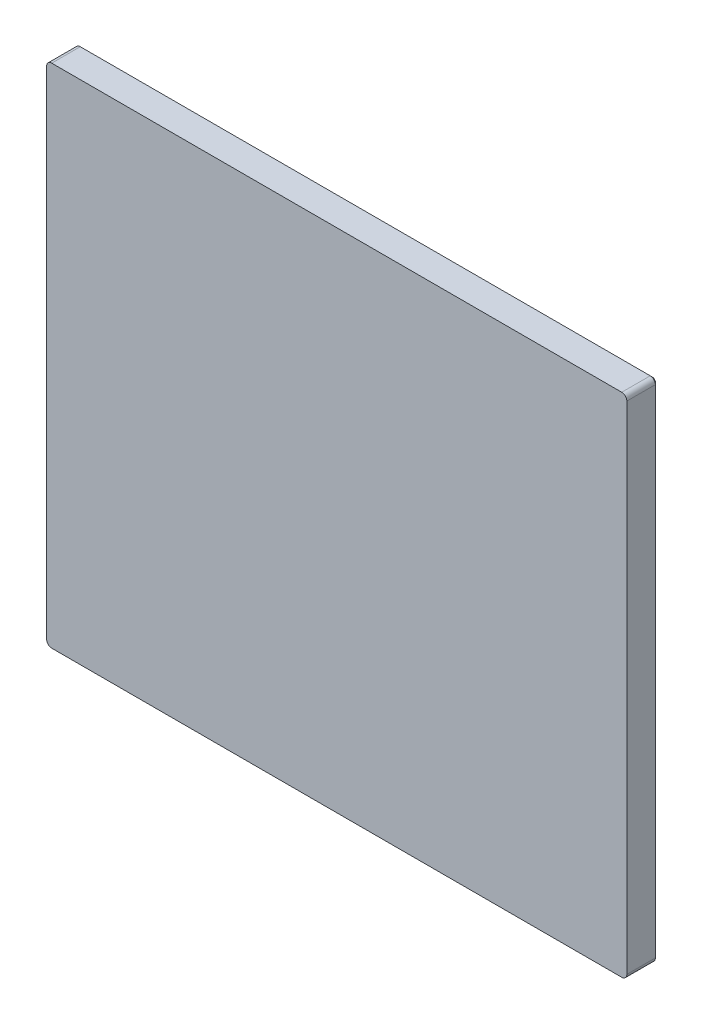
ISO-10303-21;
HEADER;
FILE_DESCRIPTION(('STEP AP214'),'2;1');
FILE_NAME('part.step','',(''),(''),'','','');
FILE_SCHEMA(('AUTOMOTIVE_DESIGN { 1 0 10303 214 1 1 1 1 }'));
ENDSEC;
DATA;
#1=APPLICATION_CONTEXT('core data for automotive mechanical design processes');
#2=APPLICATION_PROTOCOL_DEFINITION('international standard','automotive_design',2000,#1);
#3=PRODUCT_CONTEXT('',#1,'mechanical');
#4=PRODUCT('Part','Part','',(#3));
#5=PRODUCT_RELATED_PRODUCT_CATEGORY('part','',(#4));
#6=PRODUCT_DEFINITION_FORMATION('','',#4);
#7=PRODUCT_DEFINITION_CONTEXT('part definition',#1,'design');
#8=PRODUCT_DEFINITION('design','',#6,#7);
#9=PRODUCT_DEFINITION_SHAPE('','',#8);
#10=(LENGTH_UNIT() NAMED_UNIT(*) SI_UNIT(.MILLI.,.METRE.));
#11=(NAMED_UNIT(*) PLANE_ANGLE_UNIT() SI_UNIT($,.RADIAN.));
#12=(NAMED_UNIT(*) SI_UNIT($,.STERADIAN.) SOLID_ANGLE_UNIT());
#13=UNCERTAINTY_MEASURE_WITH_UNIT(LENGTH_MEASURE(1.E-05),#10,'distance_accuracy_value','');
#14=(GEOMETRIC_REPRESENTATION_CONTEXT(3) GLOBAL_UNCERTAINTY_ASSIGNED_CONTEXT((#13)) GLOBAL_UNIT_ASSIGNED_CONTEXT((#10,
#11,#12)) REPRESENTATION_CONTEXT('',''));
#15=CARTESIAN_POINT('',(0.,0.,0.));
#16=DIRECTION('',(0.,0.,1.));
#17=DIRECTION('',(1.,0.,0.));
#18=AXIS2_PLACEMENT_3D('',#15,#16,#17);
#19=CARTESIAN_POINT('',(180.34,-157.48,10.));
#20=DIRECTION('',(-1.,0.,0.));
#21=DIRECTION('',(0.,-1.,0.));
#22=AXIS2_PLACEMENT_3D('',#19,#20,#21);
#23=PLANE('',#22);
#24=DIRECTION('',(0.,1.,0.));
#25=VECTOR('',#24,1.);
#26=CARTESIAN_POINT('',(180.34,-154.305,9.));
#27=LINE('',#26,#25);
#28=CARTESIAN_POINT('',(180.34,-154.305,9.));
#29=VERTEX_POINT('',#28);
#30=CARTESIAN_POINT('',(180.34,154.305,9.));
#31=VERTEX_POINT('',#30);
#32=EDGE_CURVE('E757',#29,#31,#27,.T.);
#33=ORIENTED_EDGE('',*,*,#32,.F.);
#34=DIRECTION('',(0.,0.,-1.));
#35=VECTOR('',#34,1.);
#36=CARTESIAN_POINT('',(180.34,-154.305,10.));
#37=LINE('',#36,#35);
#38=CARTESIAN_POINT('',(180.34,-154.305,-8.73));
#39=VERTEX_POINT('',#38);
#40=EDGE_CURVE('E341',#29,#39,#37,.T.);
#41=ORIENTED_EDGE('',*,*,#40,.T.);
#42=DIRECTION('',(0.,1.,0.));
#43=VECTOR('',#42,1.);
#44=CARTESIAN_POINT('',(180.34,154.305,-8.73));
#45=LINE('',#44,#43);
#46=CARTESIAN_POINT('',(180.34,154.305,-8.73));
#47=VERTEX_POINT('',#46);
#48=EDGE_CURVE('E9',#39,#47,#45,.T.);
#49=ORIENTED_EDGE('',*,*,#48,.T.);
#50=DIRECTION('',(0.,0.,-1.));
#51=VECTOR('',#50,1.);
#52=CARTESIAN_POINT('',(180.34,154.305,10.));
#53=LINE('',#52,#51);
#54=EDGE_CURVE('E345',#47,#31,#53,.F.);
#55=ORIENTED_EDGE('',*,*,#54,.T.);
#56=EDGE_LOOP('',(#33,#41,#49,#55));
#57=FACE_BOUND('',#56,.T.);
#58=ADVANCED_FACE('F14',(#57),#23,.F.);
#59=CARTESIAN_POINT('',(-180.34,157.48,10.));
#60=DIRECTION('',(0.,-1.,0.));
#61=DIRECTION('',(1.,0.,0.));
#62=AXIS2_PLACEMENT_3D('',#59,#60,#61);
#63=PLANE('',#62);
#64=DIRECTION('',(-1.,0.,0.));
#65=VECTOR('',#64,1.);
#66=CARTESIAN_POINT('',(177.165,157.48,9.));
#67=LINE('',#66,#65);
#68=CARTESIAN_POINT('',(177.165,157.48,9.));
#69=VERTEX_POINT('',#68);
#70=CARTESIAN_POINT('',(-177.165,157.48,9.));
#71=VERTEX_POINT('',#70);
#72=EDGE_CURVE('E784',#69,#71,#67,.T.);
#73=ORIENTED_EDGE('',*,*,#72,.F.);
#74=DIRECTION('',(0.,0.,-1.));
#75=VECTOR('',#74,1.);
#76=CARTESIAN_POINT('',(177.165,157.48,10.));
#77=LINE('',#76,#75);
#78=CARTESIAN_POINT('',(177.165,157.48,-8.73));
#79=VERTEX_POINT('',#78);
#80=EDGE_CURVE('E351',#69,#79,#77,.T.);
#81=ORIENTED_EDGE('',*,*,#80,.T.);
#82=DIRECTION('',(-1.,0.,0.));
#83=VECTOR('',#82,1.);
#84=CARTESIAN_POINT('',(-177.165,157.48,-8.73));
#85=LINE('',#84,#83);
#86=CARTESIAN_POINT('',(-177.165,157.48,-8.73));
#87=VERTEX_POINT('',#86);
#88=EDGE_CURVE('E383',#79,#87,#85,.T.);
#89=ORIENTED_EDGE('',*,*,#88,.T.);
#90=DIRECTION('',(0.,0.,-1.));
#91=VECTOR('',#90,1.);
#92=CARTESIAN_POINT('',(-177.165,157.48,10.));
#93=LINE('',#92,#91);
#94=EDGE_CURVE('E343',#87,#71,#93,.F.);
#95=ORIENTED_EDGE('',*,*,#94,.T.);
#96=EDGE_LOOP('',(#73,#81,#89,#95));
#97=FACE_BOUND('',#96,.T.);
#98=ADVANCED_FACE('F777',(#97),#63,.F.);
#99=CARTESIAN_POINT('',(-180.34,-157.48,10.));
#100=DIRECTION('',(1.,0.,0.));
#101=DIRECTION('',(0.,1.,0.));
#102=AXIS2_PLACEMENT_3D('',#99,#100,#101);
#103=PLANE('',#102);
#104=DIRECTION('',(0.,-1.,0.));
#105=VECTOR('',#104,1.);
#106=CARTESIAN_POINT('',(-180.34,154.305,9.));
#107=LINE('',#106,#105);
#108=CARTESIAN_POINT('',(-180.34,154.305,9.));
#109=VERTEX_POINT('',#108);
#110=CARTESIAN_POINT('',(-180.34,-154.305,9.));
#111=VERTEX_POINT('',#110);
#112=EDGE_CURVE('E31',#109,#111,#107,.T.);
#113=ORIENTED_EDGE('',*,*,#112,.F.);
#114=DIRECTION('',(0.,0.,-1.));
#115=VECTOR('',#114,1.);
#116=CARTESIAN_POINT('',(-180.34,154.305,10.));
#117=LINE('',#116,#115);
#118=CARTESIAN_POINT('',(-180.34,154.305,-8.73));
#119=VERTEX_POINT('',#118);
#120=EDGE_CURVE('E355',#109,#119,#117,.T.);
#121=ORIENTED_EDGE('',*,*,#120,.T.);
#122=DIRECTION('',(0.,-1.,0.));
#123=VECTOR('',#122,1.);
#124=CARTESIAN_POINT('',(-180.34,-154.305,-8.73));
#125=LINE('',#124,#123);
#126=CARTESIAN_POINT('',(-180.34,-154.305,-8.73));
#127=VERTEX_POINT('',#126);
#128=EDGE_CURVE('E357',#119,#127,#125,.T.);
#129=ORIENTED_EDGE('',*,*,#128,.T.);
#130=DIRECTION('',(0.,0.,-1.));
#131=VECTOR('',#130,1.);
#132=CARTESIAN_POINT('',(-180.34,-154.305,10.));
#133=LINE('',#132,#131);
#134=EDGE_CURVE('E353',#127,#111,#133,.F.);
#135=ORIENTED_EDGE('',*,*,#134,.T.);
#136=EDGE_LOOP('',(#113,#121,#129,#135));
#137=FACE_BOUND('',#136,.T.);
#138=ADVANCED_FACE('F833',(#137),#103,.F.);
#139=CARTESIAN_POINT('',(-180.34,-157.48,10.));
#140=DIRECTION('',(0.,1.,0.));
#141=DIRECTION('',(-1.,0.,0.));
#142=AXIS2_PLACEMENT_3D('',#139,#140,#141);
#143=PLANE('',#142);
#144=DIRECTION('',(1.,0.,0.));
#145=VECTOR('',#144,1.);
#146=CARTESIAN_POINT('',(-177.165,-157.48,9.));
#147=LINE('',#146,#145);
#148=CARTESIAN_POINT('',(-177.165,-157.48,9.));
#149=VERTEX_POINT('',#148);
#150=CARTESIAN_POINT('',(177.165,-157.48,9.));
#151=VERTEX_POINT('',#150);
#152=EDGE_CURVE('E320',#149,#151,#147,.T.);
#153=ORIENTED_EDGE('',*,*,#152,.F.);
#154=DIRECTION('',(0.,0.,-1.));
#155=VECTOR('',#154,1.);
#156=CARTESIAN_POINT('',(-177.165,-157.48,10.));
#157=LINE('',#156,#155);
#158=CARTESIAN_POINT('',(-177.165,-157.48,-8.73));
#159=VERTEX_POINT('',#158);
#160=EDGE_CURVE('E331',#149,#159,#157,.T.);
#161=ORIENTED_EDGE('',*,*,#160,.T.);
#162=DIRECTION('',(1.,0.,0.));
#163=VECTOR('',#162,1.);
#164=CARTESIAN_POINT('',(177.165,-157.48,-8.73));
#165=LINE('',#164,#163);
#166=CARTESIAN_POINT('',(177.165,-157.48,-8.73));
#167=VERTEX_POINT('',#166);
#168=EDGE_CURVE('E381',#159,#167,#165,.T.);
#169=ORIENTED_EDGE('',*,*,#168,.T.);
#170=DIRECTION('',(0.,0.,-1.));
#171=VECTOR('',#170,1.);
#172=CARTESIAN_POINT('',(177.165,-157.48,10.));
#173=LINE('',#172,#171);
#174=EDGE_CURVE('E334',#167,#151,#173,.F.);
#175=ORIENTED_EDGE('',*,*,#174,.T.);
#176=EDGE_LOOP('',(#153,#161,#169,#175));
#177=FACE_BOUND('',#176,.T.);
#178=ADVANCED_FACE('F330',(#177),#143,.F.);
#179=CARTESIAN_POINT('',(177.165,-154.305,10.));
#180=DIRECTION('',(0.,0.,-1.));
#181=DIRECTION('',(0.,1.,0.));
#182=AXIS2_PLACEMENT_3D('',#179,#180,#181);
#183=CYLINDRICAL_SURFACE('',#182,3.175);
#184=ORIENTED_EDGE('',*,*,#40,.F.);
#185=CARTESIAN_POINT('',(177.165,-154.305,9.));
#186=DIRECTION('',(0.,0.,1.));
#187=DIRECTION('',(1.,0.,0.));
#188=AXIS2_PLACEMENT_3D('',#185,#186,#187);
#189=CIRCLE('',#188,3.175);
#190=EDGE_CURVE('E335',#151,#29,#189,.T.);
#191=ORIENTED_EDGE('',*,*,#190,.F.);
#192=ORIENTED_EDGE('',*,*,#174,.F.);
#193=CARTESIAN_POINT('',(177.165,-154.305,-8.73));
#194=DIRECTION('',(0.,0.,-1.));
#195=DIRECTION('',(0.,1.,0.));
#196=AXIS2_PLACEMENT_3D('',#193,#194,#195);
#197=CIRCLE('',#196,3.175);
#198=EDGE_CURVE('E385',#167,#39,#197,.F.);
#199=ORIENTED_EDGE('',*,*,#198,.T.);
#200=EDGE_LOOP('',(#184,#191,#192,#199));
#201=FACE_BOUND('',#200,.T.);
#202=ADVANCED_FACE('F935',(#201),#183,.T.);
#203=CARTESIAN_POINT('',(177.165,154.305,10.));
#204=DIRECTION('',(0.,0.,-1.));
#205=DIRECTION('',(0.,1.,0.));
#206=AXIS2_PLACEMENT_3D('',#203,#204,#205);
#207=CYLINDRICAL_SURFACE('',#206,3.175);
#208=ORIENTED_EDGE('',*,*,#80,.F.);
#209=CARTESIAN_POINT('',(177.165,154.305,9.));
#210=DIRECTION('',(0.,0.,1.));
#211=DIRECTION('',(1.,0.,0.));
#212=AXIS2_PLACEMENT_3D('',#209,#210,#211);
#213=CIRCLE('',#212,3.175);
#214=EDGE_CURVE('E764',#31,#69,#213,.T.);
#215=ORIENTED_EDGE('',*,*,#214,.F.);
#216=ORIENTED_EDGE('',*,*,#54,.F.);
#217=CARTESIAN_POINT('',(177.165,154.305,-8.73));
#218=DIRECTION('',(0.,0.,-1.));
#219=DIRECTION('',(0.,1.,0.));
#220=AXIS2_PLACEMENT_3D('',#217,#218,#219);
#221=CIRCLE('',#220,3.175);
#222=EDGE_CURVE('E23',#47,#79,#221,.F.);
#223=ORIENTED_EDGE('',*,*,#222,.T.);
#224=EDGE_LOOP('',(#208,#215,#216,#223));
#225=FACE_BOUND('',#224,.T.);
#226=ADVANCED_FACE('F762',(#225),#207,.T.);
#227=CARTESIAN_POINT('',(-177.165,154.305,10.));
#228=DIRECTION('',(0.,0.,-1.));
#229=DIRECTION('',(0.,1.,0.));
#230=AXIS2_PLACEMENT_3D('',#227,#228,#229);
#231=CYLINDRICAL_SURFACE('',#230,3.175);
#232=ORIENTED_EDGE('',*,*,#120,.F.);
#233=CARTESIAN_POINT('',(-177.165,154.305,9.));
#234=DIRECTION('',(0.,0.,1.));
#235=DIRECTION('',(1.,0.,0.));
#236=AXIS2_PLACEMENT_3D('',#233,#234,#235);
#237=CIRCLE('',#236,3.175);
#238=EDGE_CURVE('E783',#71,#109,#237,.T.);
#239=ORIENTED_EDGE('',*,*,#238,.F.);
#240=ORIENTED_EDGE('',*,*,#94,.F.);
#241=CARTESIAN_POINT('',(-177.165,154.305,-8.73));
#242=DIRECTION('',(0.,0.,-1.));
#243=DIRECTION('',(0.,1.,0.));
#244=AXIS2_PLACEMENT_3D('',#241,#242,#243);
#245=CIRCLE('',#244,3.175);
#246=EDGE_CURVE('E378',#87,#119,#245,.F.);
#247=ORIENTED_EDGE('',*,*,#246,.T.);
#248=EDGE_LOOP('',(#232,#239,#240,#247));
#249=FACE_BOUND('',#248,.T.);
#250=ADVANCED_FACE('F781',(#249),#231,.T.);
#251=CARTESIAN_POINT('',(-177.165,-154.305,10.));
#252=DIRECTION('',(0.,0.,-1.));
#253=DIRECTION('',(0.,1.,0.));
#254=AXIS2_PLACEMENT_3D('',#251,#252,#253);
#255=CYLINDRICAL_SURFACE('',#254,3.175);
#256=ORIENTED_EDGE('',*,*,#160,.F.);
#257=CARTESIAN_POINT('',(-177.165,-154.305,9.));
#258=DIRECTION('',(0.,0.,1.));
#259=DIRECTION('',(1.,0.,0.));
#260=AXIS2_PLACEMENT_3D('',#257,#258,#259);
#261=CIRCLE('',#260,3.175);
#262=EDGE_CURVE('E317',#111,#149,#261,.T.);
#263=ORIENTED_EDGE('',*,*,#262,.F.);
#264=ORIENTED_EDGE('',*,*,#134,.F.);
#265=CARTESIAN_POINT('',(-177.165,-154.305,-8.73));
#266=DIRECTION('',(0.,0.,-1.));
#267=DIRECTION('',(0.,1.,0.));
#268=AXIS2_PLACEMENT_3D('',#265,#266,#267);
#269=CIRCLE('',#268,3.175);
#270=EDGE_CURVE('E339',#127,#159,#269,.F.);
#271=ORIENTED_EDGE('',*,*,#270,.T.);
#272=EDGE_LOOP('',(#256,#263,#264,#271));
#273=FACE_BOUND('',#272,.T.);
#274=ADVANCED_FACE('F337',(#273),#255,.T.);
#275=CARTESIAN_POINT('',(180.34,157.48,-10.));
#276=DIRECTION('',(0.,0.,-1.));
#277=DIRECTION('',(0.,1.,0.));
#278=AXIS2_PLACEMENT_3D('',#275,#276,#277);
#279=PLANE('',#278);
#280=CARTESIAN_POINT('',(-135.,0.,-10.));
#281=DIRECTION('',(0.,0.,-1.));
#282=DIRECTION('',(-1.,0.,0.));
#283=AXIS2_PLACEMENT_3D('',#280,#281,#282);
#284=CIRCLE('',#283,7.27000000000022);
#285=CARTESIAN_POINT('',(-142.27,0.,-10.));
#286=VERTEX_POINT('',#285);
#287=EDGE_CURVE('E801',#286,#286,#284,.T.);
#288=ORIENTED_EDGE('',*,*,#287,.F.);
#289=EDGE_LOOP('',(#288));
#290=FACE_BOUND('',#289,.T.);
#291=CARTESIAN_POINT('',(135.,0.,-10.));
#292=DIRECTION('',(0.,0.,1.));
#293=DIRECTION('',(1.,0.,0.));
#294=AXIS2_PLACEMENT_3D('',#291,#292,#293);
#295=CIRCLE('',#294,7.27000000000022);
#296=CARTESIAN_POINT('',(142.27,0.,-10.));
#297=VERTEX_POINT('',#296);
#298=EDGE_CURVE('E792',#297,#297,#295,.T.);
#299=ORIENTED_EDGE('',*,*,#298,.T.);
#300=EDGE_LOOP('',(#299));
#301=FACE_BOUND('',#300,.T.);
#302=CARTESIAN_POINT('',(-177.165,-154.305,-10.));
#303=DIRECTION('',(0.,0.,-1.));
#304=DIRECTION('',(0.,1.,0.));
#305=AXIS2_PLACEMENT_3D('',#302,#303,#304);
#306=CIRCLE('',#305,1.905);
#307=CARTESIAN_POINT('',(-177.165,-156.21,-10.));
#308=VERTEX_POINT('',#307);
#309=CARTESIAN_POINT('',(-179.07,-154.305,-10.));
#310=VERTEX_POINT('',#309);
#311=EDGE_CURVE('E372',#308,#310,#306,.T.);
#312=ORIENTED_EDGE('',*,*,#311,.T.);
#313=DIRECTION('',(0.,1.,0.));
#314=VECTOR('',#313,1.);
#315=CARTESIAN_POINT('',(-179.07,154.305,-10.));
#316=LINE('',#315,#314);
#317=CARTESIAN_POINT('',(-179.07,154.305,-10.));
#318=VERTEX_POINT('',#317);
#319=EDGE_CURVE('E374',#310,#318,#316,.T.);
#320=ORIENTED_EDGE('',*,*,#319,.T.);
#321=CARTESIAN_POINT('',(-177.165,154.305,-10.));
#322=DIRECTION('',(0.,0.,-1.));
#323=DIRECTION('',(0.,1.,0.));
#324=AXIS2_PLACEMENT_3D('',#321,#322,#323);
#325=CIRCLE('',#324,1.905);
#326=CARTESIAN_POINT('',(-177.165,156.21,-10.));
#327=VERTEX_POINT('',#326);
#328=EDGE_CURVE('E370',#318,#327,#325,.T.);
#329=ORIENTED_EDGE('',*,*,#328,.T.);
#330=DIRECTION('',(1.,0.,0.));
#331=VECTOR('',#330,1.);
#332=CARTESIAN_POINT('',(177.165,156.21,-10.));
#333=LINE('',#332,#331);
#334=CARTESIAN_POINT('',(177.165,156.21,-10.));
#335=VERTEX_POINT('',#334);
#336=EDGE_CURVE('E366',#327,#335,#333,.T.);
#337=ORIENTED_EDGE('',*,*,#336,.T.);
#338=CARTESIAN_POINT('',(177.165,154.305,-10.));
#339=DIRECTION('',(0.,0.,-1.));
#340=DIRECTION('',(0.,1.,0.));
#341=AXIS2_PLACEMENT_3D('',#338,#339,#340);
#342=CIRCLE('',#341,1.905);
#343=CARTESIAN_POINT('',(179.07,154.305,-10.));
#344=VERTEX_POINT('',#343);
#345=EDGE_CURVE('E362',#335,#344,#342,.T.);
#346=ORIENTED_EDGE('',*,*,#345,.T.);
#347=DIRECTION('',(0.,-1.,0.));
#348=VECTOR('',#347,1.);
#349=CARTESIAN_POINT('',(179.07,-154.305,-10.));
#350=LINE('',#349,#348);
#351=CARTESIAN_POINT('',(179.07,-154.305,-10.));
#352=VERTEX_POINT('',#351);
#353=EDGE_CURVE('E360',#344,#352,#350,.T.);
#354=ORIENTED_EDGE('',*,*,#353,.T.);
#355=CARTESIAN_POINT('',(177.165,-154.305,-10.));
#356=DIRECTION('',(0.,0.,-1.));
#357=DIRECTION('',(0.,1.,0.));
#358=AXIS2_PLACEMENT_3D('',#355,#356,#357);
#359=CIRCLE('',#358,1.905);
#360=CARTESIAN_POINT('',(177.165,-156.21,-10.));
#361=VERTEX_POINT('',#360);
#362=EDGE_CURVE('E364',#352,#361,#359,.T.);
#363=ORIENTED_EDGE('',*,*,#362,.T.);
#364=DIRECTION('',(-1.,0.,0.));
#365=VECTOR('',#364,1.);
#366=CARTESIAN_POINT('',(-177.165,-156.21,-10.));
#367=LINE('',#366,#365);
#368=EDGE_CURVE('E368',#361,#308,#367,.T.);
#369=ORIENTED_EDGE('',*,*,#368,.T.);
#370=EDGE_LOOP('',(#312,#320,#329,#337,#346,#354,#363,#369));
#371=FACE_BOUND('',#370,.T.);
#372=CARTESIAN_POINT('',(-136.779,-138.43,-10.));
#373=DIRECTION('',(0.,0.,-1.));
#374=DIRECTION('',(0.,1.,0.));
#375=AXIS2_PLACEMENT_3D('',#372,#373,#374);
#376=CIRCLE('',#375,1.905);
#377=CARTESIAN_POINT('',(-136.779,-136.525,-10.));
#378=VERTEX_POINT('',#377);
#379=EDGE_CURVE('E412',#378,#378,#376,.T.);
#380=ORIENTED_EDGE('',*,*,#379,.F.);
#381=EDGE_LOOP('',(#380));
#382=FACE_BOUND('',#381,.T.);
#383=CARTESIAN_POINT('',(-136.779,138.43,-10.));
#384=DIRECTION('',(0.,0.,-1.));
#385=DIRECTION('',(0.,1.,0.));
#386=AXIS2_PLACEMENT_3D('',#383,#384,#385);
#387=CIRCLE('',#386,1.905);
#388=CARTESIAN_POINT('',(-136.779,140.335,-10.));
#389=VERTEX_POINT('',#388);
#390=EDGE_CURVE('E423',#389,#389,#387,.T.);
#391=ORIENTED_EDGE('',*,*,#390,.F.);
#392=EDGE_LOOP('',(#391));
#393=FACE_BOUND('',#392,.T.);
#394=CARTESIAN_POINT('',(136.779,138.43,-10.));
#395=DIRECTION('',(0.,0.,-1.));
#396=DIRECTION('',(0.,1.,0.));
#397=AXIS2_PLACEMENT_3D('',#394,#395,#396);
#398=CIRCLE('',#397,1.905);
#399=CARTESIAN_POINT('',(136.779,140.335,-10.));
#400=VERTEX_POINT('',#399);
#401=EDGE_CURVE('E433',#400,#400,#398,.T.);
#402=ORIENTED_EDGE('',*,*,#401,.F.);
#403=EDGE_LOOP('',(#402));
#404=FACE_BOUND('',#403,.T.);
#405=CARTESIAN_POINT('',(136.779,-138.43,-10.));
#406=DIRECTION('',(0.,0.,-1.));
#407=DIRECTION('',(0.,1.,0.));
#408=AXIS2_PLACEMENT_3D('',#405,#406,#407);
#409=CIRCLE('',#408,1.905);
#410=CARTESIAN_POINT('',(136.779,-136.525,-10.));
#411=VERTEX_POINT('',#410);
#412=EDGE_CURVE('E439',#411,#411,#409,.T.);
#413=ORIENTED_EDGE('',*,*,#412,.F.);
#414=EDGE_LOOP('',(#413));
#415=FACE_BOUND('',#414,.T.);
#416=CARTESIAN_POINT('',(165.57625,10.00125,-10.));
#417=DIRECTION('',(0.,0.,-1.));
#418=DIRECTION('',(0.,1.,0.));
#419=AXIS2_PLACEMENT_3D('',#416,#417,#418);
#420=CIRCLE('',#419,11.27125);
#421=CARTESIAN_POINT('',(172.221826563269,0.89754807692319,-10.));
#422=VERTEX_POINT('',#421);
#423=CARTESIAN_POINT('',(172.221826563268,19.1049519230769,-10.));
#424=VERTEX_POINT('',#423);
#425=EDGE_CURVE('E639',#422,#424,#420,.F.);
#426=ORIENTED_EDGE('',*,*,#425,.T.);
#427=CARTESIAN_POINT('',(172.877024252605,20.0025,-10.));
#428=DIRECTION('',(0.,0.,-1.));
#429=DIRECTION('',(0.,1.,0.));
#430=AXIS2_PLACEMENT_3D('',#427,#428,#429);
#431=CIRCLE('',#430,1.11125000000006);
#432=CARTESIAN_POINT('',(172.221826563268,20.9000480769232,-10.));
#433=VERTEX_POINT('',#432);
#434=EDGE_CURVE('E641',#424,#433,#431,.T.);
#435=ORIENTED_EDGE('',*,*,#434,.T.);
#436=CARTESIAN_POINT('',(165.57625,30.00375,-10.));
#437=DIRECTION('',(0.,0.,-1.));
#438=DIRECTION('',(0.,1.,0.));
#439=AXIS2_PLACEMENT_3D('',#436,#437,#438);
#440=CIRCLE('',#439,11.27125);
#441=CARTESIAN_POINT('',(165.57625,41.275,-10.));
#442=VERTEX_POINT('',#441);
#443=EDGE_CURVE('E637',#433,#442,#440,.F.);
#444=ORIENTED_EDGE('',*,*,#443,.T.);
#445=DIRECTION('',(-1.,0.,0.));
#446=VECTOR('',#445,1.);
#447=CARTESIAN_POINT('',(155.5115,41.275,-10.));
#448=LINE('',#447,#446);
#449=CARTESIAN_POINT('',(155.5115,41.275,-10.));
#450=VERTEX_POINT('',#449);
#451=EDGE_CURVE('E633',#442,#450,#448,.T.);
#452=ORIENTED_EDGE('',*,*,#451,.T.);
#453=CARTESIAN_POINT('',(155.5115,35.2425,-10.));
#454=DIRECTION('',(0.,0.,-1.));
#455=DIRECTION('',(0.,1.,0.));
#456=AXIS2_PLACEMENT_3D('',#453,#454,#455);
#457=CIRCLE('',#456,6.0325);
#458=CARTESIAN_POINT('',(149.479,35.2425,-10.));
#459=VERTEX_POINT('',#458);
#460=EDGE_CURVE('E629',#450,#459,#457,.F.);
#461=ORIENTED_EDGE('',*,*,#460,.T.);
#462=DIRECTION('',(0.,-1.,0.));
#463=VECTOR('',#462,1.);
#464=CARTESIAN_POINT('',(149.479,-35.2425,-10.));
#465=LINE('',#464,#463);
#466=CARTESIAN_POINT('',(149.479,-35.2425,-10.));
#467=VERTEX_POINT('',#466);
#468=EDGE_CURVE('E625',#459,#467,#465,.T.);
#469=ORIENTED_EDGE('',*,*,#468,.T.);
#470=CARTESIAN_POINT('',(155.5115,-35.2425,-10.));
#471=DIRECTION('',(0.,0.,-1.));
#472=DIRECTION('',(0.,1.,0.));
#473=AXIS2_PLACEMENT_3D('',#470,#471,#472);
#474=CIRCLE('',#473,6.0325);
#475=CARTESIAN_POINT('',(155.5115,-41.275,-10.));
#476=VERTEX_POINT('',#475);
#477=EDGE_CURVE('E621',#467,#476,#474,.F.);
#478=ORIENTED_EDGE('',*,*,#477,.T.);
#479=DIRECTION('',(1.,0.,0.));
#480=VECTOR('',#479,1.);
#481=CARTESIAN_POINT('',(165.57625,-41.275,-10.));
#482=LINE('',#481,#480);
#483=CARTESIAN_POINT('',(165.57625,-41.275,-10.));
#484=VERTEX_POINT('',#483);
#485=EDGE_CURVE('E619',#476,#484,#482,.T.);
#486=ORIENTED_EDGE('',*,*,#485,.T.);
#487=CARTESIAN_POINT('',(165.57625,-30.00375,-10.));
#488=DIRECTION('',(0.,0.,-1.));
#489=DIRECTION('',(0.,1.,0.));
#490=AXIS2_PLACEMENT_3D('',#487,#488,#489);
#491=CIRCLE('',#490,11.27125);
#492=CARTESIAN_POINT('',(172.221826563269,-20.900048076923,-10.));
#493=VERTEX_POINT('',#492);
#494=EDGE_CURVE('E623',#484,#493,#491,.F.);
#495=ORIENTED_EDGE('',*,*,#494,.T.);
#496=CARTESIAN_POINT('',(172.877024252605,-20.0025,-10.));
#497=DIRECTION('',(0.,0.,-1.));
#498=DIRECTION('',(0.,1.,0.));
#499=AXIS2_PLACEMENT_3D('',#496,#497,#498);
#500=CIRCLE('',#499,1.11125000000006);
#501=CARTESIAN_POINT('',(172.221826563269,-19.1049519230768,-10.));
#502=VERTEX_POINT('',#501);
#503=EDGE_CURVE('E627',#493,#502,#500,.T.);
#504=ORIENTED_EDGE('',*,*,#503,.T.);
#505=CARTESIAN_POINT('',(165.57625,-10.00125,-10.));
#506=DIRECTION('',(0.,0.,-1.));
#507=DIRECTION('',(0.,1.,0.));
#508=AXIS2_PLACEMENT_3D('',#505,#506,#507);
#509=CIRCLE('',#508,11.27125);
#510=CARTESIAN_POINT('',(172.221826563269,-0.897548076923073,-10.));
#511=VERTEX_POINT('',#510);
#512=EDGE_CURVE('E631',#502,#511,#509,.F.);
#513=ORIENTED_EDGE('',*,*,#512,.T.);
#514=CARTESIAN_POINT('',(172.877024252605,0.,-10.));
#515=DIRECTION('',(0.,0.,-1.));
#516=DIRECTION('',(0.,1.,0.));
#517=AXIS2_PLACEMENT_3D('',#514,#515,#516);
#518=CIRCLE('',#517,1.11125000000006);
#519=EDGE_CURVE('E635',#511,#422,#518,.T.);
#520=ORIENTED_EDGE('',*,*,#519,.T.);
#521=EDGE_LOOP('',(#426,#435,#444,#452,#461,#469,#478,#486,#495,#504,#513,#520));
#522=FACE_BOUND('',#521,.T.);
#523=CARTESIAN_POINT('',(-165.57625,30.00375,-10.));
#524=DIRECTION('',(0.,0.,-1.));
#525=DIRECTION('',(0.,1.,0.));
#526=AXIS2_PLACEMENT_3D('',#523,#524,#525);
#527=CIRCLE('',#526,11.27125);
#528=CARTESIAN_POINT('',(-165.57625,41.275,-10.));
#529=VERTEX_POINT('',#528);
#530=CARTESIAN_POINT('',(-172.221826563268,20.9000480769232,-10.));
#531=VERTEX_POINT('',#530);
#532=EDGE_CURVE('E614',#529,#531,#527,.F.);
#533=ORIENTED_EDGE('',*,*,#532,.T.);
#534=CARTESIAN_POINT('',(-172.877024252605,20.0025,-10.));
#535=DIRECTION('',(0.,0.,-1.));
#536=DIRECTION('',(0.,1.,0.));
#537=AXIS2_PLACEMENT_3D('',#534,#535,#536);
#538=CIRCLE('',#537,1.11125000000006);
#539=CARTESIAN_POINT('',(-172.221826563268,19.1049519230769,-10.));
#540=VERTEX_POINT('',#539);
#541=EDGE_CURVE('E616',#531,#540,#538,.T.);
#542=ORIENTED_EDGE('',*,*,#541,.T.);
#543=CARTESIAN_POINT('',(-165.57625,10.00125,-10.));
#544=DIRECTION('',(0.,0.,-1.));
#545=DIRECTION('',(0.,1.,0.));
#546=AXIS2_PLACEMENT_3D('',#543,#544,#545);
#547=CIRCLE('',#546,11.27125);
#548=CARTESIAN_POINT('',(-172.221826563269,0.897548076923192,-10.));
#549=VERTEX_POINT('',#548);
#550=EDGE_CURVE('E612',#540,#549,#547,.F.);
#551=ORIENTED_EDGE('',*,*,#550,.T.);
#552=CARTESIAN_POINT('',(-172.877024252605,0.,-10.));
#553=DIRECTION('',(0.,0.,-1.));
#554=DIRECTION('',(0.,1.,0.));
#555=AXIS2_PLACEMENT_3D('',#552,#553,#554);
#556=CIRCLE('',#555,1.11125000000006);
#557=CARTESIAN_POINT('',(-172.221826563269,-0.897548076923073,-10.));
#558=VERTEX_POINT('',#557);
#559=EDGE_CURVE('E608',#549,#558,#556,.T.);
#560=ORIENTED_EDGE('',*,*,#559,.T.);
#561=CARTESIAN_POINT('',(-165.57625,-10.00125,-10.));
#562=DIRECTION('',(0.,0.,-1.));
#563=DIRECTION('',(0.,1.,0.));
#564=AXIS2_PLACEMENT_3D('',#561,#562,#563);
#565=CIRCLE('',#564,11.27125);
#566=CARTESIAN_POINT('',(-172.221826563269,-19.1049519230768,-10.));
#567=VERTEX_POINT('',#566);
#568=EDGE_CURVE('E604',#558,#567,#565,.F.);
#569=ORIENTED_EDGE('',*,*,#568,.T.);
#570=CARTESIAN_POINT('',(-172.877024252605,-20.0025,-10.));
#571=DIRECTION('',(0.,0.,-1.));
#572=DIRECTION('',(0.,1.,0.));
#573=AXIS2_PLACEMENT_3D('',#570,#571,#572);
#574=CIRCLE('',#573,1.11125000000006);
#575=CARTESIAN_POINT('',(-172.221826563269,-20.900048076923,-10.));
#576=VERTEX_POINT('',#575);
#577=EDGE_CURVE('E600',#567,#576,#574,.T.);
#578=ORIENTED_EDGE('',*,*,#577,.T.);
#579=CARTESIAN_POINT('',(-165.57625,-30.00375,-10.));
#580=DIRECTION('',(0.,0.,-1.));
#581=DIRECTION('',(0.,1.,0.));
#582=AXIS2_PLACEMENT_3D('',#579,#580,#581);
#583=CIRCLE('',#582,11.27125);
#584=CARTESIAN_POINT('',(-165.57625,-41.275,-10.));
#585=VERTEX_POINT('',#584);
#586=EDGE_CURVE('E596',#576,#585,#583,.F.);
#587=ORIENTED_EDGE('',*,*,#586,.T.);
#588=DIRECTION('',(1.,0.,0.));
#589=VECTOR('',#588,1.);
#590=CARTESIAN_POINT('',(-155.5115,-41.275,-10.));
#591=LINE('',#590,#589);
#592=CARTESIAN_POINT('',(-155.5115,-41.275,-10.));
#593=VERTEX_POINT('',#592);
#594=EDGE_CURVE('E594',#585,#593,#591,.T.);
#595=ORIENTED_EDGE('',*,*,#594,.T.);
#596=CARTESIAN_POINT('',(-155.5115,-35.2425,-10.));
#597=DIRECTION('',(0.,0.,-1.));
#598=DIRECTION('',(0.,1.,0.));
#599=AXIS2_PLACEMENT_3D('',#596,#597,#598);
#600=CIRCLE('',#599,6.0325);
#601=CARTESIAN_POINT('',(-149.479,-35.2425,-10.));
#602=VERTEX_POINT('',#601);
#603=EDGE_CURVE('E598',#593,#602,#600,.F.);
#604=ORIENTED_EDGE('',*,*,#603,.T.);
#605=DIRECTION('',(0.,1.,0.));
#606=VECTOR('',#605,1.);
#607=CARTESIAN_POINT('',(-149.479,35.2425,-10.));
#608=LINE('',#607,#606);
#609=CARTESIAN_POINT('',(-149.479,35.2425,-10.));
#610=VERTEX_POINT('',#609);
#611=EDGE_CURVE('E602',#602,#610,#608,.T.);
#612=ORIENTED_EDGE('',*,*,#611,.T.);
#613=CARTESIAN_POINT('',(-155.5115,35.2425,-10.));
#614=DIRECTION('',(0.,0.,-1.));
#615=DIRECTION('',(0.,1.,0.));
#616=AXIS2_PLACEMENT_3D('',#613,#614,#615);
#617=CIRCLE('',#616,6.0325);
#618=CARTESIAN_POINT('',(-155.5115,41.275,-10.));
#619=VERTEX_POINT('',#618);
#620=EDGE_CURVE('E606',#610,#619,#617,.F.);
#621=ORIENTED_EDGE('',*,*,#620,.T.);
#622=DIRECTION('',(-1.,0.,0.));
#623=VECTOR('',#622,1.);
#624=CARTESIAN_POINT('',(-165.57625,41.275,-10.));
#625=LINE('',#624,#623);
#626=EDGE_CURVE('E610',#619,#529,#625,.T.);
#627=ORIENTED_EDGE('',*,*,#626,.T.);
#628=EDGE_LOOP('',(#533,#542,#551,#560,#569,#578,#587,#595,#604,#612,#621,#627));
#629=FACE_BOUND('',#628,.T.);
#630=ADVANCED_FACE('F945',(#290,#301,#371,#382,#393,#404,#415,#522,#629),#279,.T.);
#631=CARTESIAN_POINT('',(-165.57625,-30.00375,-6.825));
#632=DIRECTION('',(0.,0.,-1.));
#633=DIRECTION('',(0.,1.,0.));
#634=AXIS2_PLACEMENT_3D('',#631,#632,#633);
#635=CYLINDRICAL_SURFACE('',#634,10.00125);
#636=DIRECTION('',(0.,0.,-1.));
#637=VECTOR('',#636,1.);
#638=CARTESIAN_POINT('',(-165.57625,-40.005,-6.825));
#639=LINE('',#638,#637);
#640=CARTESIAN_POINT('',(-165.57625,-40.005,-6.825));
#641=VERTEX_POINT('',#640);
#642=CARTESIAN_POINT('',(-165.57625,-40.005,-8.73));
#643=VERTEX_POINT('',#642);
#644=EDGE_CURVE('E556',#641,#643,#639,.T.);
#645=ORIENTED_EDGE('',*,*,#644,.T.);
#646=CARTESIAN_POINT('',(-165.57625,-30.00375,-8.73));
#647=DIRECTION('',(0.,0.,-1.));
#648=DIRECTION('',(0.,1.,0.));
#649=AXIS2_PLACEMENT_3D('',#646,#647,#648);
#650=CIRCLE('',#649,10.00125);
#651=CARTESIAN_POINT('',(-171.473029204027,-21.9258173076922,-8.73));
#652=VERTEX_POINT('',#651);
#653=EDGE_CURVE('E687',#643,#652,#650,.T.);
#654=ORIENTED_EDGE('',*,*,#653,.T.);
#655=DIRECTION('',(0.,0.,-1.));
#656=VECTOR('',#655,1.);
#657=CARTESIAN_POINT('',(-171.473029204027,-21.9258173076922,-6.825));
#658=LINE('',#657,#656);
#659=CARTESIAN_POINT('',(-171.473029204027,-21.9258173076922,-6.825));
#660=VERTEX_POINT('',#659);
#661=EDGE_CURVE('E555',#660,#652,#658,.T.);
#662=ORIENTED_EDGE('',*,*,#661,.F.);
#663=CARTESIAN_POINT('',(-165.57625,-30.00375,-6.825));
#664=DIRECTION('',(0.,0.,-1.));
#665=DIRECTION('',(0.,-1.,0.));
#666=AXIS2_PLACEMENT_3D('',#663,#664,#665);
#667=CIRCLE('',#666,10.00125);
#668=EDGE_CURVE('E487',#641,#660,#667,.T.);
#669=ORIENTED_EDGE('',*,*,#668,.F.);
#670=EDGE_LOOP('',(#645,#654,#662,#669));
#671=FACE_BOUND('',#670,.T.);
#672=ADVANCED_FACE('F1072',(#671),#635,.F.);
#673=CARTESIAN_POINT('',(-165.57625,-40.005,-6.825));
#674=DIRECTION('',(0.,-1.,0.));
#675=DIRECTION('',(1.,0.,0.));
#676=AXIS2_PLACEMENT_3D('',#673,#674,#675);
#677=PLANE('',#676);
#678=DIRECTION('',(0.,0.,-1.));
#679=VECTOR('',#678,1.);
#680=CARTESIAN_POINT('',(-155.5115,-40.005,-6.825));
#681=LINE('',#680,#679);
#682=CARTESIAN_POINT('',(-155.5115,-40.005,-6.825));
#683=VERTEX_POINT('',#682);
#684=CARTESIAN_POINT('',(-155.5115,-40.005,-8.73));
#685=VERTEX_POINT('',#684);
#686=EDGE_CURVE('E560',#683,#685,#681,.T.);
#687=ORIENTED_EDGE('',*,*,#686,.T.);
#688=DIRECTION('',(-1.,0.,0.));
#689=VECTOR('',#688,1.);
#690=CARTESIAN_POINT('',(-165.57625,-40.005,-8.73));
#691=LINE('',#690,#689);
#692=EDGE_CURVE('E689',#685,#643,#691,.T.);
#693=ORIENTED_EDGE('',*,*,#692,.T.);
#694=ORIENTED_EDGE('',*,*,#644,.F.);
#695=DIRECTION('',(-1.,0.,0.));
#696=VECTOR('',#695,1.);
#697=CARTESIAN_POINT('',(-165.57625,-40.005,-6.825));
#698=LINE('',#697,#696);
#699=EDGE_CURVE('E552',#683,#641,#698,.T.);
#700=ORIENTED_EDGE('',*,*,#699,.F.);
#701=EDGE_LOOP('',(#687,#693,#694,#700));
#702=FACE_BOUND('',#701,.T.);
#703=ADVANCED_FACE('F1068',(#702),#677,.F.);
#704=CARTESIAN_POINT('',(-155.5115,-35.2425,-6.825));
#705=DIRECTION('',(0.,0.,-1.));
#706=DIRECTION('',(0.,1.,0.));
#707=AXIS2_PLACEMENT_3D('',#704,#705,#706);
#708=CYLINDRICAL_SURFACE('',#707,4.7625);
#709=DIRECTION('',(0.,0.,-1.));
#710=VECTOR('',#709,1.);
#711=CARTESIAN_POINT('',(-150.749,-35.2425,-6.825));
#712=LINE('',#711,#710);
#713=CARTESIAN_POINT('',(-150.749,-35.2425,-6.825));
#714=VERTEX_POINT('',#713);
#715=CARTESIAN_POINT('',(-150.749,-35.2425,-8.73));
#716=VERTEX_POINT('',#715);
#717=EDGE_CURVE('E563',#714,#716,#712,.T.);
#718=ORIENTED_EDGE('',*,*,#717,.T.);
#719=CARTESIAN_POINT('',(-155.5115,-35.2425,-8.73));
#720=DIRECTION('',(0.,0.,-1.));
#721=DIRECTION('',(0.,1.,0.));
#722=AXIS2_PLACEMENT_3D('',#719,#720,#721);
#723=CIRCLE('',#722,4.7625);
#724=EDGE_CURVE('E685',#716,#685,#723,.T.);
#725=ORIENTED_EDGE('',*,*,#724,.T.);
#726=ORIENTED_EDGE('',*,*,#686,.F.);
#727=CARTESIAN_POINT('',(-155.5115,-35.2425,-6.825));
#728=DIRECTION('',(0.,0.,-1.));
#729=DIRECTION('',(0.,-1.,0.));
#730=AXIS2_PLACEMENT_3D('',#727,#728,#729);
#731=CIRCLE('',#730,4.7625);
#732=EDGE_CURVE('E549',#714,#683,#731,.T.);
#733=ORIENTED_EDGE('',*,*,#732,.F.);
#734=EDGE_LOOP('',(#718,#725,#726,#733));
#735=FACE_BOUND('',#734,.T.);
#736=ADVANCED_FACE('F1071',(#735),#708,.F.);
#737=CARTESIAN_POINT('',(-150.749,-35.2425,-6.825));
#738=DIRECTION('',(1.,0.,0.));
#739=DIRECTION('',(0.,1.,0.));
#740=AXIS2_PLACEMENT_3D('',#737,#738,#739);
#741=PLANE('',#740);
#742=DIRECTION('',(0.,0.,-1.));
#743=VECTOR('',#742,1.);
#744=CARTESIAN_POINT('',(-150.749,35.2425,-6.825));
#745=LINE('',#744,#743);
#746=CARTESIAN_POINT('',(-150.749,35.2425,-6.825));
#747=VERTEX_POINT('',#746);
#748=CARTESIAN_POINT('',(-150.749,35.2425,-8.73));
#749=VERTEX_POINT('',#748);
#750=EDGE_CURVE('E566',#747,#749,#745,.T.);
#751=ORIENTED_EDGE('',*,*,#750,.T.);
#752=DIRECTION('',(0.,-1.,0.));
#753=VECTOR('',#752,1.);
#754=CARTESIAN_POINT('',(-150.749,-35.2425,-8.73));
#755=LINE('',#754,#753);
#756=EDGE_CURVE('E681',#749,#716,#755,.T.);
#757=ORIENTED_EDGE('',*,*,#756,.T.);
#758=ORIENTED_EDGE('',*,*,#717,.F.);
#759=DIRECTION('',(0.,-1.,0.));
#760=VECTOR('',#759,1.);
#761=CARTESIAN_POINT('',(-150.749,-35.2425,-6.825));
#762=LINE('',#761,#760);
#763=EDGE_CURVE('E546',#747,#714,#762,.T.);
#764=ORIENTED_EDGE('',*,*,#763,.F.);
#765=EDGE_LOOP('',(#751,#757,#758,#764));
#766=FACE_BOUND('',#765,.T.);
#767=ADVANCED_FACE('F1076',(#766),#741,.F.);
#768=CARTESIAN_POINT('',(-155.5115,35.2425,-6.825));
#769=DIRECTION('',(0.,0.,-1.));
#770=DIRECTION('',(0.,1.,0.));
#771=AXIS2_PLACEMENT_3D('',#768,#769,#770);
#772=CYLINDRICAL_SURFACE('',#771,4.7625);
#773=DIRECTION('',(0.,0.,-1.));
#774=VECTOR('',#773,1.);
#775=CARTESIAN_POINT('',(-155.5115,40.005,-6.825));
#776=LINE('',#775,#774);
#777=CARTESIAN_POINT('',(-155.5115,40.005,-6.825));
#778=VERTEX_POINT('',#777);
#779=CARTESIAN_POINT('',(-155.5115,40.005,-8.73));
#780=VERTEX_POINT('',#779);
#781=EDGE_CURVE('E569',#778,#780,#776,.T.);
#782=ORIENTED_EDGE('',*,*,#781,.T.);
#783=CARTESIAN_POINT('',(-155.5115,35.2425,-8.73));
#784=DIRECTION('',(0.,0.,-1.));
#785=DIRECTION('',(0.,1.,0.));
#786=AXIS2_PLACEMENT_3D('',#783,#784,#785);
#787=CIRCLE('',#786,4.7625);
#788=EDGE_CURVE('E677',#780,#749,#787,.T.);
#789=ORIENTED_EDGE('',*,*,#788,.T.);
#790=ORIENTED_EDGE('',*,*,#750,.F.);
#791=CARTESIAN_POINT('',(-155.5115,35.2425,-6.825));
#792=DIRECTION('',(0.,0.,-1.));
#793=DIRECTION('',(0.,1.,0.));
#794=AXIS2_PLACEMENT_3D('',#791,#792,#793);
#795=CIRCLE('',#794,4.7625);
#796=EDGE_CURVE('E543',#778,#747,#795,.T.);
#797=ORIENTED_EDGE('',*,*,#796,.F.);
#798=EDGE_LOOP('',(#782,#789,#790,#797));
#799=FACE_BOUND('',#798,.T.);
#800=ADVANCED_FACE('F1080',(#799),#772,.F.);
#801=CARTESIAN_POINT('',(-165.57625,40.005,-6.825));
#802=DIRECTION('',(0.,1.,0.));
#803=DIRECTION('',(-1.,0.,0.));
#804=AXIS2_PLACEMENT_3D('',#801,#802,#803);
#805=PLANE('',#804);
#806=DIRECTION('',(0.,0.,-1.));
#807=VECTOR('',#806,1.);
#808=CARTESIAN_POINT('',(-165.57625,40.005,-6.825));
#809=LINE('',#808,#807);
#810=CARTESIAN_POINT('',(-165.57625,40.005,-6.825));
#811=VERTEX_POINT('',#810);
#812=CARTESIAN_POINT('',(-165.57625,40.005,-8.73));
#813=VERTEX_POINT('',#812);
#814=EDGE_CURVE('E572',#811,#813,#809,.T.);
#815=ORIENTED_EDGE('',*,*,#814,.T.);
#816=DIRECTION('',(1.,0.,0.));
#817=VECTOR('',#816,1.);
#818=CARTESIAN_POINT('',(-155.5115,40.005,-8.73));
#819=LINE('',#818,#817);
#820=EDGE_CURVE('E673',#813,#780,#819,.T.);
#821=ORIENTED_EDGE('',*,*,#820,.T.);
#822=ORIENTED_EDGE('',*,*,#781,.F.);
#823=DIRECTION('',(1.,0.,0.));
#824=VECTOR('',#823,1.);
#825=CARTESIAN_POINT('',(-165.57625,40.005,-6.825));
#826=LINE('',#825,#824);
#827=EDGE_CURVE('E540',#811,#778,#826,.T.);
#828=ORIENTED_EDGE('',*,*,#827,.F.);
#829=EDGE_LOOP('',(#815,#821,#822,#828));
#830=FACE_BOUND('',#829,.T.);
#831=ADVANCED_FACE('F1084',(#830),#805,.F.);
#832=CARTESIAN_POINT('',(-165.57625,30.00375,-6.825));
#833=DIRECTION('',(0.,0.,-1.));
#834=DIRECTION('',(0.,1.,0.));
#835=AXIS2_PLACEMENT_3D('',#832,#833,#834);
#836=CYLINDRICAL_SURFACE('',#835,10.00125);
#837=DIRECTION('',(0.,0.,-1.));
#838=VECTOR('',#837,1.);
#839=CARTESIAN_POINT('',(-171.473029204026,21.9258173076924,-6.825));
#840=LINE('',#839,#838);
#841=CARTESIAN_POINT('',(-171.473029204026,21.9258173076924,-6.825));
#842=VERTEX_POINT('',#841);
#843=CARTESIAN_POINT('',(-171.473029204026,21.9258173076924,-8.73));
#844=VERTEX_POINT('',#843);
#845=EDGE_CURVE('E575',#842,#844,#840,.T.);
#846=ORIENTED_EDGE('',*,*,#845,.T.);
#847=CARTESIAN_POINT('',(-165.57625,30.00375,-8.73));
#848=DIRECTION('',(0.,0.,-1.));
#849=DIRECTION('',(0.,1.,0.));
#850=AXIS2_PLACEMENT_3D('',#847,#848,#849);
#851=CIRCLE('',#850,10.00125);
#852=EDGE_CURVE('E669',#844,#813,#851,.T.);
#853=ORIENTED_EDGE('',*,*,#852,.T.);
#854=ORIENTED_EDGE('',*,*,#814,.F.);
#855=CARTESIAN_POINT('',(-165.57625,30.00375,-6.825));
#856=DIRECTION('',(0.,0.,-1.));
#857=DIRECTION('',(0.,-1.,0.));
#858=AXIS2_PLACEMENT_3D('',#855,#856,#857);
#859=CIRCLE('',#858,10.00125);
#860=EDGE_CURVE('E537',#842,#811,#859,.T.);
#861=ORIENTED_EDGE('',*,*,#860,.F.);
#862=EDGE_LOOP('',(#846,#853,#854,#861));
#863=FACE_BOUND('',#862,.T.);
#864=ADVANCED_FACE('F1088',(#863),#836,.F.);
#865=CARTESIAN_POINT('',(-172.877024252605,20.0025,-6.825));
#866=DIRECTION('',(0.,0.,-1.));
#867=DIRECTION('',(0.,1.,0.));
#868=AXIS2_PLACEMENT_3D('',#865,#866,#867);
#869=CYLINDRICAL_SURFACE('',#868,2.38125);
#870=DIRECTION('',(0.,0.,-1.));
#871=VECTOR('',#870,1.);
#872=CARTESIAN_POINT('',(-171.473029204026,18.0791826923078,-6.825));
#873=LINE('',#872,#871);
#874=CARTESIAN_POINT('',(-171.473029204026,18.0791826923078,-6.825));
#875=VERTEX_POINT('',#874);
#876=CARTESIAN_POINT('',(-171.473029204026,18.0791826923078,-8.73));
#877=VERTEX_POINT('',#876);
#878=EDGE_CURVE('E578',#875,#877,#873,.T.);
#879=ORIENTED_EDGE('',*,*,#878,.T.);
#880=CARTESIAN_POINT('',(-172.877024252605,20.0025,-8.73));
#881=DIRECTION('',(0.,0.,-1.));
#882=DIRECTION('',(0.,1.,0.));
#883=AXIS2_PLACEMENT_3D('',#880,#881,#882);
#884=CIRCLE('',#883,2.38125);
#885=EDGE_CURVE('E666',#877,#844,#884,.F.);
#886=ORIENTED_EDGE('',*,*,#885,.T.);
#887=ORIENTED_EDGE('',*,*,#845,.F.);
#888=CARTESIAN_POINT('',(-172.877024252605,20.0025,-6.825));
#889=DIRECTION('',(0.,0.,1.));
#890=DIRECTION('',(0.,-1.,0.));
#891=AXIS2_PLACEMENT_3D('',#888,#889,#890);
#892=CIRCLE('',#891,2.38125);
#893=EDGE_CURVE('E534',#875,#842,#892,.T.);
#894=ORIENTED_EDGE('',*,*,#893,.F.);
#895=EDGE_LOOP('',(#879,#886,#887,#894));
#896=FACE_BOUND('',#895,.T.);
#897=ADVANCED_FACE('F1092',(#896),#869,.T.);
#898=CARTESIAN_POINT('',(-165.57625,10.00125,-6.825));
#899=DIRECTION('',(0.,0.,-1.));
#900=DIRECTION('',(0.,1.,0.));
#901=AXIS2_PLACEMENT_3D('',#898,#899,#900);
#902=CYLINDRICAL_SURFACE('',#901,10.00125);
#903=DIRECTION('',(0.,0.,-1.));
#904=VECTOR('',#903,1.);
#905=CARTESIAN_POINT('',(-171.473029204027,1.92331730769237,-6.825));
#906=LINE('',#905,#904);
#907=CARTESIAN_POINT('',(-171.473029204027,1.92331730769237,-6.825));
#908=VERTEX_POINT('',#907);
#909=CARTESIAN_POINT('',(-171.473029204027,1.92331730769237,-8.73));
#910=VERTEX_POINT('',#909);
#911=EDGE_CURVE('E581',#908,#910,#906,.T.);
#912=ORIENTED_EDGE('',*,*,#911,.T.);
#913=CARTESIAN_POINT('',(-165.57625,10.00125,-8.73));
#914=DIRECTION('',(0.,0.,-1.));
#915=DIRECTION('',(0.,1.,0.));
#916=AXIS2_PLACEMENT_3D('',#913,#914,#915);
#917=CIRCLE('',#916,10.00125);
#918=EDGE_CURVE('E671',#910,#877,#917,.T.);
#919=ORIENTED_EDGE('',*,*,#918,.T.);
#920=ORIENTED_EDGE('',*,*,#878,.F.);
#921=CARTESIAN_POINT('',(-165.57625,10.00125,-6.825));
#922=DIRECTION('',(0.,0.,-1.));
#923=DIRECTION('',(0.,-1.,0.));
#924=AXIS2_PLACEMENT_3D('',#921,#922,#923);
#925=CIRCLE('',#924,10.00125);
#926=EDGE_CURVE('E531',#908,#875,#925,.T.);
#927=ORIENTED_EDGE('',*,*,#926,.F.);
#928=EDGE_LOOP('',(#912,#919,#920,#927));
#929=FACE_BOUND('',#928,.T.);
#930=ADVANCED_FACE('F1096',(#929),#902,.F.);
#931=CARTESIAN_POINT('',(-172.877024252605,0.,-6.825));
#932=DIRECTION('',(0.,0.,-1.));
#933=DIRECTION('',(0.,1.,0.));
#934=AXIS2_PLACEMENT_3D('',#931,#932,#933);
#935=CYLINDRICAL_SURFACE('',#934,2.38125);
#936=DIRECTION('',(0.,0.,-1.));
#937=VECTOR('',#936,1.);
#938=CARTESIAN_POINT('',(-171.473029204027,-1.92331730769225,-6.825));
#939=LINE('',#938,#937);
#940=CARTESIAN_POINT('',(-171.473029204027,-1.92331730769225,-6.825));
#941=VERTEX_POINT('',#940);
#942=CARTESIAN_POINT('',(-171.473029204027,-1.92331730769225,-8.73));
#943=VERTEX_POINT('',#942);
#944=EDGE_CURVE('E584',#941,#943,#939,.T.);
#945=ORIENTED_EDGE('',*,*,#944,.T.);
#946=CARTESIAN_POINT('',(-172.877024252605,0.,-8.73));
#947=DIRECTION('',(0.,0.,-1.));
#948=DIRECTION('',(0.,1.,0.));
#949=AXIS2_PLACEMENT_3D('',#946,#947,#948);
#950=CIRCLE('',#949,2.38125);
#951=EDGE_CURVE('E675',#943,#910,#950,.F.);
#952=ORIENTED_EDGE('',*,*,#951,.T.);
#953=ORIENTED_EDGE('',*,*,#911,.F.);
#954=CARTESIAN_POINT('',(-172.877024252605,0.,-6.825));
#955=DIRECTION('',(0.,0.,1.));
#956=DIRECTION('',(0.,-1.,0.));
#957=AXIS2_PLACEMENT_3D('',#954,#955,#956);
#958=CIRCLE('',#957,2.38125);
#959=EDGE_CURVE('E528',#941,#908,#958,.T.);
#960=ORIENTED_EDGE('',*,*,#959,.F.);
#961=EDGE_LOOP('',(#945,#952,#953,#960));
#962=FACE_BOUND('',#961,.T.);
#963=ADVANCED_FACE('F1100',(#962),#935,.T.);
#964=CARTESIAN_POINT('',(-165.57625,-10.00125,-6.825));
#965=DIRECTION('',(0.,0.,-1.));
#966=DIRECTION('',(0.,1.,0.));
#967=AXIS2_PLACEMENT_3D('',#964,#965,#966);
#968=CYLINDRICAL_SURFACE('',#967,10.00125);
#969=DIRECTION('',(0.,0.,-1.));
#970=VECTOR('',#969,1.);
#971=CARTESIAN_POINT('',(-171.473029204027,-18.0791826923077,-6.825));
#972=LINE('',#971,#970);
#973=CARTESIAN_POINT('',(-171.473029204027,-18.0791826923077,-6.825));
#974=VERTEX_POINT('',#973);
#975=CARTESIAN_POINT('',(-171.473029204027,-18.0791826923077,-8.73));
#976=VERTEX_POINT('',#975);
#977=EDGE_CURVE('E587',#974,#976,#972,.T.);
#978=ORIENTED_EDGE('',*,*,#977,.T.);
#979=CARTESIAN_POINT('',(-165.57625,-10.00125,-8.73));
#980=DIRECTION('',(0.,0.,-1.));
#981=DIRECTION('',(0.,1.,0.));
#982=AXIS2_PLACEMENT_3D('',#979,#980,#981);
#983=CIRCLE('',#982,10.00125);
#984=EDGE_CURVE('E679',#976,#943,#983,.T.);
#985=ORIENTED_EDGE('',*,*,#984,.T.);
#986=ORIENTED_EDGE('',*,*,#944,.F.);
#987=CARTESIAN_POINT('',(-165.57625,-10.00125,-6.825));
#988=DIRECTION('',(0.,0.,-1.));
#989=DIRECTION('',(0.,-1.,0.));
#990=AXIS2_PLACEMENT_3D('',#987,#988,#989);
#991=CIRCLE('',#990,10.00125);
#992=EDGE_CURVE('E525',#974,#941,#991,.T.);
#993=ORIENTED_EDGE('',*,*,#992,.F.);
#994=EDGE_LOOP('',(#978,#985,#986,#993));
#995=FACE_BOUND('',#994,.T.);
#996=ADVANCED_FACE('F1104',(#995),#968,.F.);
#997=CARTESIAN_POINT('',(-172.877024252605,-20.0025,-6.825));
#998=DIRECTION('',(0.,0.,-1.));
#999=DIRECTION('',(0.,1.,0.));
#1000=AXIS2_PLACEMENT_3D('',#997,#998,#999);
#1001=CYLINDRICAL_SURFACE('',#1000,2.38125);
#1002=ORIENTED_EDGE('',*,*,#661,.T.);
#1003=CARTESIAN_POINT('',(-172.877024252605,-20.0025,-8.73));
#1004=DIRECTION('',(0.,0.,-1.));
#1005=DIRECTION('',(0.,1.,0.));
#1006=AXIS2_PLACEMENT_3D('',#1003,#1004,#1005);
#1007=CIRCLE('',#1006,2.38125);
#1008=EDGE_CURVE('E683',#652,#976,#1007,.F.);
#1009=ORIENTED_EDGE('',*,*,#1008,.T.);
#1010=ORIENTED_EDGE('',*,*,#977,.F.);
#1011=CARTESIAN_POINT('',(-172.877024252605,-20.0025,-6.825));
#1012=DIRECTION('',(0.,0.,1.));
#1013=DIRECTION('',(0.,-1.,0.));
#1014=AXIS2_PLACEMENT_3D('',#1011,#1012,#1013);
#1015=CIRCLE('',#1014,2.38125);
#1016=EDGE_CURVE('E522',#660,#974,#1015,.T.);
#1017=ORIENTED_EDGE('',*,*,#1016,.F.);
#1018=EDGE_LOOP('',(#1002,#1009,#1010,#1017));
#1019=FACE_BOUND('',#1018,.T.);
#1020=ADVANCED_FACE('F1066',(#1019),#1001,.T.);
#1021=CARTESIAN_POINT('',(-165.57625,-30.00375,-6.825));
#1022=DIRECTION('',(0.,0.,1.));
#1023=DIRECTION('',(0.,-1.,0.));
#1024=AXIS2_PLACEMENT_3D('',#1021,#1022,#1023);
#1025=PLANE('',#1024);
#1026=ORIENTED_EDGE('',*,*,#668,.T.);
#1027=ORIENTED_EDGE('',*,*,#1016,.T.);
#1028=ORIENTED_EDGE('',*,*,#992,.T.);
#1029=ORIENTED_EDGE('',*,*,#959,.T.);
#1030=ORIENTED_EDGE('',*,*,#926,.T.);
#1031=ORIENTED_EDGE('',*,*,#893,.T.);
#1032=ORIENTED_EDGE('',*,*,#860,.T.);
#1033=ORIENTED_EDGE('',*,*,#827,.T.);
#1034=ORIENTED_EDGE('',*,*,#796,.T.);
#1035=ORIENTED_EDGE('',*,*,#763,.T.);
#1036=ORIENTED_EDGE('',*,*,#732,.T.);
#1037=ORIENTED_EDGE('',*,*,#699,.T.);
#1038=EDGE_LOOP('',(#1026,#1027,#1028,#1029,#1030,#1031,#1032,#1033,#1034,#1035,#1036,#1037));
#1039=FACE_BOUND('',#1038,.T.);
#1040=ADVANCED_FACE('F1062',(#1039),#1025,.F.);
#1041=CARTESIAN_POINT('',(155.5115,35.2425,-6.825));
#1042=DIRECTION('',(0.,0.,-1.));
#1043=DIRECTION('',(0.,1.,0.));
#1044=AXIS2_PLACEMENT_3D('',#1041,#1042,#1043);
#1045=CYLINDRICAL_SURFACE('',#1044,4.7625);
#1046=DIRECTION('',(0.,0.,-1.));
#1047=VECTOR('',#1046,1.);
#1048=CARTESIAN_POINT('',(150.749,35.2425,-6.825));
#1049=LINE('',#1048,#1047);
#1050=CARTESIAN_POINT('',(150.749,35.2425,-6.825));
#1051=VERTEX_POINT('',#1050);
#1052=CARTESIAN_POINT('',(150.749,35.2425,-8.73));
#1053=VERTEX_POINT('',#1052);
#1054=EDGE_CURVE('E484',#1051,#1053,#1049,.T.);
#1055=ORIENTED_EDGE('',*,*,#1054,.T.);
#1056=CARTESIAN_POINT('',(155.5115,35.2425,-8.73));
#1057=DIRECTION('',(0.,0.,-1.));
#1058=DIRECTION('',(0.,1.,0.));
#1059=AXIS2_PLACEMENT_3D('',#1056,#1057,#1058);
#1060=CIRCLE('',#1059,4.7625);
#1061=CARTESIAN_POINT('',(155.5115,40.005,-8.73));
#1062=VERTEX_POINT('',#1061);
#1063=EDGE_CURVE('E654',#1053,#1062,#1060,.T.);
#1064=ORIENTED_EDGE('',*,*,#1063,.T.);
#1065=DIRECTION('',(0.,0.,-1.));
#1066=VECTOR('',#1065,1.);
#1067=CARTESIAN_POINT('',(155.5115,40.005,-6.825));
#1068=LINE('',#1067,#1066);
#1069=CARTESIAN_POINT('',(155.5115,40.005,-6.825));
#1070=VERTEX_POINT('',#1069);
#1071=EDGE_CURVE('E483',#1070,#1062,#1068,.T.);
#1072=ORIENTED_EDGE('',*,*,#1071,.F.);
#1073=CARTESIAN_POINT('',(155.5115,35.2425,-6.825));
#1074=DIRECTION('',(0.,0.,-1.));
#1075=DIRECTION('',(0.,-1.,0.));
#1076=AXIS2_PLACEMENT_3D('',#1073,#1074,#1075);
#1077=CIRCLE('',#1076,4.7625);
#1078=EDGE_CURVE('E446',#1051,#1070,#1077,.T.);
#1079=ORIENTED_EDGE('',*,*,#1078,.F.);
#1080=EDGE_LOOP('',(#1055,#1064,#1072,#1079));
#1081=FACE_BOUND('',#1080,.T.);
#1082=ADVANCED_FACE('F1020',(#1081),#1045,.F.);
#1083=CARTESIAN_POINT('',(150.749,-35.2425,-6.825));
#1084=DIRECTION('',(-1.,0.,0.));
#1085=DIRECTION('',(0.,-1.,0.));
#1086=AXIS2_PLACEMENT_3D('',#1083,#1084,#1085);
#1087=PLANE('',#1086);
#1088=DIRECTION('',(0.,0.,-1.));
#1089=VECTOR('',#1088,1.);
#1090=CARTESIAN_POINT('',(150.749,-35.2425,-6.825));
#1091=LINE('',#1090,#1089);
#1092=CARTESIAN_POINT('',(150.749,-35.2425,-6.825));
#1093=VERTEX_POINT('',#1092);
#1094=CARTESIAN_POINT('',(150.749,-35.2425,-8.73));
#1095=VERTEX_POINT('',#1094);
#1096=EDGE_CURVE('E488',#1093,#1095,#1091,.T.);
#1097=ORIENTED_EDGE('',*,*,#1096,.T.);
#1098=DIRECTION('',(0.,1.,0.));
#1099=VECTOR('',#1098,1.);
#1100=CARTESIAN_POINT('',(150.749,35.2425,-8.73));
#1101=LINE('',#1100,#1099);
#1102=EDGE_CURVE('E658',#1095,#1053,#1101,.T.);
#1103=ORIENTED_EDGE('',*,*,#1102,.T.);
#1104=ORIENTED_EDGE('',*,*,#1054,.F.);
#1105=DIRECTION('',(0.,1.,0.));
#1106=VECTOR('',#1105,1.);
#1107=CARTESIAN_POINT('',(150.749,-35.2425,-6.825));
#1108=LINE('',#1107,#1106);
#1109=EDGE_CURVE('E480',#1093,#1051,#1108,.T.);
#1110=ORIENTED_EDGE('',*,*,#1109,.F.);
#1111=EDGE_LOOP('',(#1097,#1103,#1104,#1110));
#1112=FACE_BOUND('',#1111,.T.);
#1113=ADVANCED_FACE('F1016',(#1112),#1087,.F.);
#1114=CARTESIAN_POINT('',(155.5115,-35.2425,-6.825));
#1115=DIRECTION('',(0.,0.,-1.));
#1116=DIRECTION('',(0.,1.,0.));
#1117=AXIS2_PLACEMENT_3D('',#1114,#1115,#1116);
#1118=CYLINDRICAL_SURFACE('',#1117,4.7625);
#1119=DIRECTION('',(0.,0.,-1.));
#1120=VECTOR('',#1119,1.);
#1121=CARTESIAN_POINT('',(155.5115,-40.005,-6.825));
#1122=LINE('',#1121,#1120);
#1123=CARTESIAN_POINT('',(155.5115,-40.005,-6.825));
#1124=VERTEX_POINT('',#1123);
#1125=CARTESIAN_POINT('',(155.5115,-40.005,-8.73));
#1126=VERTEX_POINT('',#1125);
#1127=EDGE_CURVE('E491',#1124,#1126,#1122,.T.);
#1128=ORIENTED_EDGE('',*,*,#1127,.T.);
#1129=CARTESIAN_POINT('',(155.5115,-35.2425,-8.73));
#1130=DIRECTION('',(0.,0.,-1.));
#1131=DIRECTION('',(0.,1.,0.));
#1132=AXIS2_PLACEMENT_3D('',#1129,#1130,#1131);
#1133=CIRCLE('',#1132,4.7625);
#1134=EDGE_CURVE('E662',#1126,#1095,#1133,.T.);
#1135=ORIENTED_EDGE('',*,*,#1134,.T.);
#1136=ORIENTED_EDGE('',*,*,#1096,.F.);
#1137=CARTESIAN_POINT('',(155.5115,-35.2425,-6.825));
#1138=DIRECTION('',(0.,0.,-1.));
#1139=DIRECTION('',(0.,1.,0.));
#1140=AXIS2_PLACEMENT_3D('',#1137,#1138,#1139);
#1141=CIRCLE('',#1140,4.7625);
#1142=EDGE_CURVE('E477',#1124,#1093,#1141,.T.);
#1143=ORIENTED_EDGE('',*,*,#1142,.F.);
#1144=EDGE_LOOP('',(#1128,#1135,#1136,#1143));
#1145=FACE_BOUND('',#1144,.T.);
#1146=ADVANCED_FACE('F1019',(#1145),#1118,.F.);
#1147=CARTESIAN_POINT('',(165.57625,-40.005,-6.825));
#1148=DIRECTION('',(0.,-1.,0.));
#1149=DIRECTION('',(1.,0.,0.));
#1150=AXIS2_PLACEMENT_3D('',#1147,#1148,#1149);
#1151=PLANE('',#1150);
#1152=DIRECTION('',(0.,0.,-1.));
#1153=VECTOR('',#1152,1.);
#1154=CARTESIAN_POINT('',(165.57625,-40.005,-6.825));
#1155=LINE('',#1154,#1153);
#1156=CARTESIAN_POINT('',(165.57625,-40.005,-6.825));
#1157=VERTEX_POINT('',#1156);
#1158=CARTESIAN_POINT('',(165.57625,-40.005,-8.73));
#1159=VERTEX_POINT('',#1158);
#1160=EDGE_CURVE('E494',#1157,#1159,#1155,.T.);
#1161=ORIENTED_EDGE('',*,*,#1160,.T.);
#1162=DIRECTION('',(-1.,0.,0.));
#1163=VECTOR('',#1162,1.);
#1164=CARTESIAN_POINT('',(155.5115,-40.005,-8.73));
#1165=LINE('',#1164,#1163);
#1166=EDGE_CURVE('E664',#1159,#1126,#1165,.T.);
#1167=ORIENTED_EDGE('',*,*,#1166,.T.);
#1168=ORIENTED_EDGE('',*,*,#1127,.F.);
#1169=DIRECTION('',(-1.,0.,0.));
#1170=VECTOR('',#1169,1.);
#1171=CARTESIAN_POINT('',(165.57625,-40.005,-6.825));
#1172=LINE('',#1171,#1170);
#1173=EDGE_CURVE('E474',#1157,#1124,#1172,.T.);
#1174=ORIENTED_EDGE('',*,*,#1173,.F.);
#1175=EDGE_LOOP('',(#1161,#1167,#1168,#1174));
#1176=FACE_BOUND('',#1175,.T.);
#1177=ADVANCED_FACE('F1024',(#1176),#1151,.F.);
#1178=CARTESIAN_POINT('',(165.57625,-30.00375,-6.825));
#1179=DIRECTION('',(0.,0.,-1.));
#1180=DIRECTION('',(0.,1.,0.));
#1181=AXIS2_PLACEMENT_3D('',#1178,#1179,#1180);
#1182=CYLINDRICAL_SURFACE('',#1181,10.00125);
#1183=DIRECTION('',(0.,0.,-1.));
#1184=VECTOR('',#1183,1.);
#1185=CARTESIAN_POINT('',(171.473029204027,-21.9258173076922,-6.825));
#1186=LINE('',#1185,#1184);
#1187=CARTESIAN_POINT('',(171.473029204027,-21.9258173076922,-6.825));
#1188=VERTEX_POINT('',#1187);
#1189=CARTESIAN_POINT('',(171.473029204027,-21.9258173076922,-8.73));
#1190=VERTEX_POINT('',#1189);
#1191=EDGE_CURVE('E497',#1188,#1190,#1186,.T.);
#1192=ORIENTED_EDGE('',*,*,#1191,.T.);
#1193=CARTESIAN_POINT('',(165.57625,-30.00375,-8.73));
#1194=DIRECTION('',(0.,0.,-1.));
#1195=DIRECTION('',(0.,1.,0.));
#1196=AXIS2_PLACEMENT_3D('',#1193,#1194,#1195);
#1197=CIRCLE('',#1196,10.00125);
#1198=EDGE_CURVE('E660',#1190,#1159,#1197,.T.);
#1199=ORIENTED_EDGE('',*,*,#1198,.T.);
#1200=ORIENTED_EDGE('',*,*,#1160,.F.);
#1201=CARTESIAN_POINT('',(165.57625,-30.00375,-6.825));
#1202=DIRECTION('',(0.,0.,-1.));
#1203=DIRECTION('',(0.,1.,0.));
#1204=AXIS2_PLACEMENT_3D('',#1201,#1202,#1203);
#1205=CIRCLE('',#1204,10.00125);
#1206=EDGE_CURVE('E471',#1188,#1157,#1205,.T.);
#1207=ORIENTED_EDGE('',*,*,#1206,.F.);
#1208=EDGE_LOOP('',(#1192,#1199,#1200,#1207));
#1209=FACE_BOUND('',#1208,.T.);
#1210=ADVANCED_FACE('F1028',(#1209),#1182,.F.);
#1211=CARTESIAN_POINT('',(172.877024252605,-20.0025,-6.825));
#1212=DIRECTION('',(0.,0.,-1.));
#1213=DIRECTION('',(0.,1.,0.));
#1214=AXIS2_PLACEMENT_3D('',#1211,#1212,#1213);
#1215=CYLINDRICAL_SURFACE('',#1214,2.38125);
#1216=DIRECTION('',(0.,0.,-1.));
#1217=VECTOR('',#1216,1.);
#1218=CARTESIAN_POINT('',(171.473029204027,-18.0791826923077,-6.825));
#1219=LINE('',#1218,#1217);
#1220=CARTESIAN_POINT('',(171.473029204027,-18.0791826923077,-6.825));
#1221=VERTEX_POINT('',#1220);
#1222=CARTESIAN_POINT('',(171.473029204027,-18.0791826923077,-8.73));
#1223=VERTEX_POINT('',#1222);
#1224=EDGE_CURVE('E500',#1221,#1223,#1219,.T.);
#1225=ORIENTED_EDGE('',*,*,#1224,.T.);
#1226=CARTESIAN_POINT('',(172.877024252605,-20.0025,-8.73));
#1227=DIRECTION('',(0.,0.,-1.));
#1228=DIRECTION('',(0.,1.,0.));
#1229=AXIS2_PLACEMENT_3D('',#1226,#1227,#1228);
#1230=CIRCLE('',#1229,2.38125);
#1231=EDGE_CURVE('E656',#1223,#1190,#1230,.F.);
#1232=ORIENTED_EDGE('',*,*,#1231,.T.);
#1233=ORIENTED_EDGE('',*,*,#1191,.F.);
#1234=CARTESIAN_POINT('',(172.877024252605,-20.0025,-6.825));
#1235=DIRECTION('',(0.,0.,1.));
#1236=DIRECTION('',(0.,1.,0.));
#1237=AXIS2_PLACEMENT_3D('',#1234,#1235,#1236);
#1238=CIRCLE('',#1237,2.38125);
#1239=EDGE_CURVE('E468',#1221,#1188,#1238,.T.);
#1240=ORIENTED_EDGE('',*,*,#1239,.F.);
#1241=EDGE_LOOP('',(#1225,#1232,#1233,#1240));
#1242=FACE_BOUND('',#1241,.T.);
#1243=ADVANCED_FACE('F1032',(#1242),#1215,.T.);
#1244=CARTESIAN_POINT('',(165.57625,-10.00125,-6.825));
#1245=DIRECTION('',(0.,0.,-1.));
#1246=DIRECTION('',(0.,1.,0.));
#1247=AXIS2_PLACEMENT_3D('',#1244,#1245,#1246);
#1248=CYLINDRICAL_SURFACE('',#1247,10.00125);
#1249=DIRECTION('',(0.,0.,-1.));
#1250=VECTOR('',#1249,1.);
#1251=CARTESIAN_POINT('',(171.473029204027,-1.92331730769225,-6.825));
#1252=LINE('',#1251,#1250);
#1253=CARTESIAN_POINT('',(171.473029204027,-1.92331730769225,-6.825));
#1254=VERTEX_POINT('',#1253);
#1255=CARTESIAN_POINT('',(171.473029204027,-1.92331730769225,-8.73));
#1256=VERTEX_POINT('',#1255);
#1257=EDGE_CURVE('E503',#1254,#1256,#1252,.T.);
#1258=ORIENTED_EDGE('',*,*,#1257,.T.);
#1259=CARTESIAN_POINT('',(165.57625,-10.00125,-8.73));
#1260=DIRECTION('',(0.,0.,-1.));
#1261=DIRECTION('',(0.,1.,0.));
#1262=AXIS2_PLACEMENT_3D('',#1259,#1260,#1261);
#1263=CIRCLE('',#1262,10.00125);
#1264=EDGE_CURVE('E652',#1256,#1223,#1263,.T.);
#1265=ORIENTED_EDGE('',*,*,#1264,.T.);
#1266=ORIENTED_EDGE('',*,*,#1224,.F.);
#1267=CARTESIAN_POINT('',(165.57625,-10.00125,-6.825));
#1268=DIRECTION('',(0.,0.,-1.));
#1269=DIRECTION('',(0.,1.,0.));
#1270=AXIS2_PLACEMENT_3D('',#1267,#1268,#1269);
#1271=CIRCLE('',#1270,10.00125);
#1272=EDGE_CURVE('E465',#1254,#1221,#1271,.T.);
#1273=ORIENTED_EDGE('',*,*,#1272,.F.);
#1274=EDGE_LOOP('',(#1258,#1265,#1266,#1273));
#1275=FACE_BOUND('',#1274,.T.);
#1276=ADVANCED_FACE('F1036',(#1275),#1248,.F.);
#1277=CARTESIAN_POINT('',(172.877024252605,0.,-6.825));
#1278=DIRECTION('',(0.,0.,-1.));
#1279=DIRECTION('',(0.,1.,0.));
#1280=AXIS2_PLACEMENT_3D('',#1277,#1278,#1279);
#1281=CYLINDRICAL_SURFACE('',#1280,2.38125);
#1282=DIRECTION('',(0.,0.,-1.));
#1283=VECTOR('',#1282,1.);
#1284=CARTESIAN_POINT('',(171.473029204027,1.92331730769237,-6.825));
#1285=LINE('',#1284,#1283);
#1286=CARTESIAN_POINT('',(171.473029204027,1.92331730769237,-6.825));
#1287=VERTEX_POINT('',#1286);
#1288=CARTESIAN_POINT('',(171.473029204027,1.92331730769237,-8.73));
#1289=VERTEX_POINT('',#1288);
#1290=EDGE_CURVE('E506',#1287,#1289,#1285,.T.);
#1291=ORIENTED_EDGE('',*,*,#1290,.T.);
#1292=CARTESIAN_POINT('',(172.877024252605,0.,-8.73));
#1293=DIRECTION('',(0.,0.,-1.));
#1294=DIRECTION('',(0.,1.,0.));
#1295=AXIS2_PLACEMENT_3D('',#1292,#1293,#1294);
#1296=CIRCLE('',#1295,2.38125);
#1297=EDGE_CURVE('E648',#1289,#1256,#1296,.F.);
#1298=ORIENTED_EDGE('',*,*,#1297,.T.);
#1299=ORIENTED_EDGE('',*,*,#1257,.F.);
#1300=CARTESIAN_POINT('',(172.877024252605,0.,-6.825));
#1301=DIRECTION('',(0.,0.,1.));
#1302=DIRECTION('',(0.,1.,0.));
#1303=AXIS2_PLACEMENT_3D('',#1300,#1301,#1302);
#1304=CIRCLE('',#1303,2.38125);
#1305=EDGE_CURVE('E462',#1287,#1254,#1304,.T.);
#1306=ORIENTED_EDGE('',*,*,#1305,.F.);
#1307=EDGE_LOOP('',(#1291,#1298,#1299,#1306));
#1308=FACE_BOUND('',#1307,.T.);
#1309=ADVANCED_FACE('F1040',(#1308),#1281,.T.);
#1310=CARTESIAN_POINT('',(165.57625,10.00125,-6.825));
#1311=DIRECTION('',(0.,0.,-1.));
#1312=DIRECTION('',(0.,1.,0.));
#1313=AXIS2_PLACEMENT_3D('',#1310,#1311,#1312);
#1314=CYLINDRICAL_SURFACE('',#1313,10.00125);
#1315=DIRECTION('',(0.,0.,-1.));
#1316=VECTOR('',#1315,1.);
#1317=CARTESIAN_POINT('',(171.473029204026,18.0791826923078,-6.825));
#1318=LINE('',#1317,#1316);
#1319=CARTESIAN_POINT('',(171.473029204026,18.0791826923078,-6.825));
#1320=VERTEX_POINT('',#1319);
#1321=CARTESIAN_POINT('',(171.473029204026,18.0791826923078,-8.73));
#1322=VERTEX_POINT('',#1321);
#1323=EDGE_CURVE('E509',#1320,#1322,#1318,.T.);
#1324=ORIENTED_EDGE('',*,*,#1323,.T.);
#1325=CARTESIAN_POINT('',(165.57625,10.00125,-8.73));
#1326=DIRECTION('',(0.,0.,-1.));
#1327=DIRECTION('',(0.,1.,0.));
#1328=AXIS2_PLACEMENT_3D('',#1325,#1326,#1327);
#1329=CIRCLE('',#1328,10.00125);
#1330=EDGE_CURVE('E644',#1322,#1289,#1329,.T.);
#1331=ORIENTED_EDGE('',*,*,#1330,.T.);
#1332=ORIENTED_EDGE('',*,*,#1290,.F.);
#1333=CARTESIAN_POINT('',(165.57625,10.00125,-6.825));
#1334=DIRECTION('',(0.,0.,-1.));
#1335=DIRECTION('',(0.,1.,0.));
#1336=AXIS2_PLACEMENT_3D('',#1333,#1334,#1335);
#1337=CIRCLE('',#1336,10.00125);
#1338=EDGE_CURVE('E459',#1320,#1287,#1337,.T.);
#1339=ORIENTED_EDGE('',*,*,#1338,.F.);
#1340=EDGE_LOOP('',(#1324,#1331,#1332,#1339));
#1341=FACE_BOUND('',#1340,.T.);
#1342=ADVANCED_FACE('F1044',(#1341),#1314,.F.);
#1343=CARTESIAN_POINT('',(172.877024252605,20.0025,-6.825));
#1344=DIRECTION('',(0.,0.,-1.));
#1345=DIRECTION('',(0.,1.,0.));
#1346=AXIS2_PLACEMENT_3D('',#1343,#1344,#1345);
#1347=CYLINDRICAL_SURFACE('',#1346,2.38125);
#1348=DIRECTION('',(0.,0.,-1.));
#1349=VECTOR('',#1348,1.);
#1350=CARTESIAN_POINT('',(171.473029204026,21.9258173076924,-6.825));
#1351=LINE('',#1350,#1349);
#1352=CARTESIAN_POINT('',(171.473029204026,21.9258173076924,-6.825));
#1353=VERTEX_POINT('',#1352);
#1354=CARTESIAN_POINT('',(171.473029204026,21.9258173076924,-8.73));
#1355=VERTEX_POINT('',#1354);
#1356=EDGE_CURVE('E512',#1353,#1355,#1351,.T.);
#1357=ORIENTED_EDGE('',*,*,#1356,.T.);
#1358=CARTESIAN_POINT('',(172.877024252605,20.0025,-8.73));
#1359=DIRECTION('',(0.,0.,-1.));
#1360=DIRECTION('',(0.,1.,0.));
#1361=AXIS2_PLACEMENT_3D('',#1358,#1359,#1360);
#1362=CIRCLE('',#1361,2.38125);
#1363=EDGE_CURVE('E559',#1355,#1322,#1362,.F.);
#1364=ORIENTED_EDGE('',*,*,#1363,.T.);
#1365=ORIENTED_EDGE('',*,*,#1323,.F.);
#1366=CARTESIAN_POINT('',(172.877024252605,20.0025,-6.825));
#1367=DIRECTION('',(0.,0.,1.));
#1368=DIRECTION('',(0.,1.,0.));
#1369=AXIS2_PLACEMENT_3D('',#1366,#1367,#1368);
#1370=CIRCLE('',#1369,2.38125);
#1371=EDGE_CURVE('E456',#1353,#1320,#1370,.T.);
#1372=ORIENTED_EDGE('',*,*,#1371,.F.);
#1373=EDGE_LOOP('',(#1357,#1364,#1365,#1372));
#1374=FACE_BOUND('',#1373,.T.);
#1375=ADVANCED_FACE('F1048',(#1374),#1347,.T.);
#1376=CARTESIAN_POINT('',(165.57625,30.00375,-6.825));
#1377=DIRECTION('',(0.,0.,-1.));
#1378=DIRECTION('',(0.,1.,0.));
#1379=AXIS2_PLACEMENT_3D('',#1376,#1377,#1378);
#1380=CYLINDRICAL_SURFACE('',#1379,10.00125);
#1381=DIRECTION('',(0.,0.,-1.));
#1382=VECTOR('',#1381,1.);
#1383=CARTESIAN_POINT('',(165.57625,40.005,-6.825));
#1384=LINE('',#1383,#1382);
#1385=CARTESIAN_POINT('',(165.57625,40.005,-6.825));
#1386=VERTEX_POINT('',#1385);
#1387=CARTESIAN_POINT('',(165.57625,40.005,-8.73));
#1388=VERTEX_POINT('',#1387);
#1389=EDGE_CURVE('E515',#1386,#1388,#1384,.T.);
#1390=ORIENTED_EDGE('',*,*,#1389,.T.);
#1391=CARTESIAN_POINT('',(165.57625,30.00375,-8.73));
#1392=DIRECTION('',(0.,0.,-1.));
#1393=DIRECTION('',(0.,1.,0.));
#1394=AXIS2_PLACEMENT_3D('',#1391,#1392,#1393);
#1395=CIRCLE('',#1394,10.00125);
#1396=EDGE_CURVE('E646',#1388,#1355,#1395,.T.);
#1397=ORIENTED_EDGE('',*,*,#1396,.T.);
#1398=ORIENTED_EDGE('',*,*,#1356,.F.);
#1399=CARTESIAN_POINT('',(165.57625,30.00375,-6.825));
#1400=DIRECTION('',(0.,0.,-1.));
#1401=DIRECTION('',(0.,1.,0.));
#1402=AXIS2_PLACEMENT_3D('',#1399,#1400,#1401);
#1403=CIRCLE('',#1402,10.00125);
#1404=EDGE_CURVE('E453',#1386,#1353,#1403,.T.);
#1405=ORIENTED_EDGE('',*,*,#1404,.F.);
#1406=EDGE_LOOP('',(#1390,#1397,#1398,#1405));
#1407=FACE_BOUND('',#1406,.T.);
#1408=ADVANCED_FACE('F1052',(#1407),#1380,.F.);
#1409=CARTESIAN_POINT('',(165.57625,40.005,-6.825));
#1410=DIRECTION('',(0.,1.,0.));
#1411=DIRECTION('',(-1.,0.,0.));
#1412=AXIS2_PLACEMENT_3D('',#1409,#1410,#1411);
#1413=PLANE('',#1412);
#1414=ORIENTED_EDGE('',*,*,#1071,.T.);
#1415=DIRECTION('',(1.,0.,0.));
#1416=VECTOR('',#1415,1.);
#1417=CARTESIAN_POINT('',(165.57625,40.005,-8.73));
#1418=LINE('',#1417,#1416);
#1419=EDGE_CURVE('E650',#1062,#1388,#1418,.T.);
#1420=ORIENTED_EDGE('',*,*,#1419,.T.);
#1421=ORIENTED_EDGE('',*,*,#1389,.F.);
#1422=DIRECTION('',(1.,0.,0.));
#1423=VECTOR('',#1422,1.);
#1424=CARTESIAN_POINT('',(165.57625,40.005,-6.825));
#1425=LINE('',#1424,#1423);
#1426=EDGE_CURVE('E449',#1070,#1386,#1425,.T.);
#1427=ORIENTED_EDGE('',*,*,#1426,.F.);
#1428=EDGE_LOOP('',(#1414,#1420,#1421,#1427));
#1429=FACE_BOUND('',#1428,.T.);
#1430=ADVANCED_FACE('F1014',(#1429),#1413,.F.);
#1431=CARTESIAN_POINT('',(155.5115,35.2425,-6.825));
#1432=DIRECTION('',(0.,0.,1.));
#1433=DIRECTION('',(0.,-1.,0.));
#1434=AXIS2_PLACEMENT_3D('',#1431,#1432,#1433);
#1435=PLANE('',#1434);
#1436=ORIENTED_EDGE('',*,*,#1078,.T.);
#1437=ORIENTED_EDGE('',*,*,#1426,.T.);
#1438=ORIENTED_EDGE('',*,*,#1404,.T.);
#1439=ORIENTED_EDGE('',*,*,#1371,.T.);
#1440=ORIENTED_EDGE('',*,*,#1338,.T.);
#1441=ORIENTED_EDGE('',*,*,#1305,.T.);
#1442=ORIENTED_EDGE('',*,*,#1272,.T.);
#1443=ORIENTED_EDGE('',*,*,#1239,.T.);
#1444=ORIENTED_EDGE('',*,*,#1206,.T.);
#1445=ORIENTED_EDGE('',*,*,#1173,.T.);
#1446=ORIENTED_EDGE('',*,*,#1142,.T.);
#1447=ORIENTED_EDGE('',*,*,#1109,.T.);
#1448=EDGE_LOOP('',(#1436,#1437,#1438,#1439,#1440,#1441,#1442,#1443,#1444,#1445,#1446,#1447));
#1449=FACE_BOUND('',#1448,.T.);
#1450=ADVANCED_FACE('F885',(#1449),#1435,.F.);
#1451=CARTESIAN_POINT('',(165.57625,-40.005,-8.73));
#1452=DIRECTION('',(0.,0.707106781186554,-0.707106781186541));
#1453=DIRECTION('',(0.,0.707106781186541,0.707106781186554));
#1454=AXIS2_PLACEMENT_3D('',#1451,#1452,#1453);
#1455=PLANE('',#1454);
#1456=DIRECTION('',(0.,0.707106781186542,0.707106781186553));
#1457=VECTOR('',#1456,1.);
#1458=CARTESIAN_POINT('',(165.57625,-41.275,-10.));
#1459=LINE('',#1458,#1457);
#1460=EDGE_CURVE('E720',#484,#1159,#1459,.T.);
#1461=ORIENTED_EDGE('',*,*,#1460,.F.);
#1462=ORIENTED_EDGE('',*,*,#485,.F.);
#1463=DIRECTION('',(0.,-0.707106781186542,-0.707106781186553));
#1464=VECTOR('',#1463,1.);
#1465=CARTESIAN_POINT('',(155.5115,-40.005,-8.73));
#1466=LINE('',#1465,#1464);
#1467=EDGE_CURVE('E450',#1126,#476,#1466,.T.);
#1468=ORIENTED_EDGE('',*,*,#1467,.F.);
#1469=ORIENTED_EDGE('',*,*,#1166,.F.);
#1470=EDGE_LOOP('',(#1461,#1462,#1468,#1469));
#1471=FACE_BOUND('',#1470,.T.);
#1472=ADVANCED_FACE('F881',(#1471),#1455,.T.);
#1473=CARTESIAN_POINT('',(155.5115,-35.2425,-8.73));
#1474=DIRECTION('',(0.,0.,-1.));
#1475=DIRECTION('',(0.,1.,0.));
#1476=AXIS2_PLACEMENT_3D('',#1473,#1474,#1475);
#1477=CONICAL_SURFACE('',#1476,4.7625,0.78539816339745);
#1478=ORIENTED_EDGE('',*,*,#1467,.T.);
#1479=ORIENTED_EDGE('',*,*,#477,.F.);
#1480=DIRECTION('',(-0.707106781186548,0.,-0.707106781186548));
#1481=VECTOR('',#1480,1.);
#1482=CARTESIAN_POINT('',(150.749,-35.2425,-8.73));
#1483=LINE('',#1482,#1481);
#1484=EDGE_CURVE('E717',#1095,#467,#1483,.T.);
#1485=ORIENTED_EDGE('',*,*,#1484,.F.);
#1486=ORIENTED_EDGE('',*,*,#1134,.F.);
#1487=EDGE_LOOP('',(#1478,#1479,#1485,#1486));
#1488=FACE_BOUND('',#1487,.T.);
#1489=ADVANCED_FACE('F877',(#1488),#1477,.F.);
#1490=CARTESIAN_POINT('',(165.57625,-30.00375,-8.73));
#1491=DIRECTION('',(0.,0.,-1.));
#1492=DIRECTION('',(0.,1.,0.));
#1493=AXIS2_PLACEMENT_3D('',#1490,#1491,#1492);
#1494=CONICAL_SURFACE('',#1493,10.00125,0.785398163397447);
#1495=ORIENTED_EDGE('',*,*,#1460,.T.);
#1496=ORIENTED_EDGE('',*,*,#1198,.F.);
#1497=DIRECTION('',(-0.416913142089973,-0.571124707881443,0.707106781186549));
#1498=VECTOR('',#1497,1.);
#1499=CARTESIAN_POINT('',(172.221826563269,-20.900048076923,-10.));
#1500=LINE('',#1499,#1498);
#1501=EDGE_CURVE('E714',#493,#1190,#1500,.T.);
#1502=ORIENTED_EDGE('',*,*,#1501,.F.);
#1503=ORIENTED_EDGE('',*,*,#494,.F.);
#1504=EDGE_LOOP('',(#1495,#1496,#1502,#1503));
#1505=FACE_BOUND('',#1504,.T.);
#1506=ADVANCED_FACE('F873',(#1505),#1494,.F.);
#1507=CARTESIAN_POINT('',(150.749,-35.2425,-8.73));
#1508=DIRECTION('',(0.707106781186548,0.,-0.707106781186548));
#1509=DIRECTION('',(0.707106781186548,0.,0.707106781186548));
#1510=AXIS2_PLACEMENT_3D('',#1507,#1508,#1509);
#1511=PLANE('',#1510);
#1512=ORIENTED_EDGE('',*,*,#1484,.T.);
#1513=ORIENTED_EDGE('',*,*,#468,.F.);
#1514=DIRECTION('',(-0.707106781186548,0.,-0.707106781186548));
#1515=VECTOR('',#1514,1.);
#1516=CARTESIAN_POINT('',(150.749,35.2425,-8.73));
#1517=LINE('',#1516,#1515);
#1518=EDGE_CURVE('E711',#1053,#459,#1517,.T.);
#1519=ORIENTED_EDGE('',*,*,#1518,.F.);
#1520=ORIENTED_EDGE('',*,*,#1102,.F.);
#1521=EDGE_LOOP('',(#1512,#1513,#1519,#1520));
#1522=FACE_BOUND('',#1521,.T.);
#1523=ADVANCED_FACE('F869',(#1522),#1511,.T.);
#1524=CARTESIAN_POINT('',(172.877024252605,-20.0025,-8.73));
#1525=DIRECTION('',(0.,0.,1.));
#1526=DIRECTION('',(0.,-1.,0.));
#1527=AXIS2_PLACEMENT_3D('',#1524,#1525,#1526);
#1528=CONICAL_SURFACE('',#1527,2.38125,0.785398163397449);
#1529=ORIENTED_EDGE('',*,*,#1501,.T.);
#1530=ORIENTED_EDGE('',*,*,#1231,.F.);
#1531=DIRECTION('',(-0.416913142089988,0.571124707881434,0.707106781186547));
#1532=VECTOR('',#1531,1.);
#1533=CARTESIAN_POINT('',(172.221826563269,-19.1049519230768,-10.));
#1534=LINE('',#1533,#1532);
#1535=EDGE_CURVE('E708',#502,#1223,#1534,.T.);
#1536=ORIENTED_EDGE('',*,*,#1535,.F.);
#1537=ORIENTED_EDGE('',*,*,#503,.F.);
#1538=EDGE_LOOP('',(#1529,#1530,#1536,#1537));
#1539=FACE_BOUND('',#1538,.T.);
#1540=ADVANCED_FACE('F865',(#1539),#1528,.T.);
#1541=CARTESIAN_POINT('',(155.5115,35.2425,-8.73));
#1542=DIRECTION('',(0.,0.,-1.));
#1543=DIRECTION('',(0.,1.,0.));
#1544=AXIS2_PLACEMENT_3D('',#1541,#1542,#1543);
#1545=CONICAL_SURFACE('',#1544,4.7625,0.785398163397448);
#1546=ORIENTED_EDGE('',*,*,#1518,.T.);
#1547=ORIENTED_EDGE('',*,*,#460,.F.);
#1548=DIRECTION('',(0.,0.707106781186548,-0.707106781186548));
#1549=VECTOR('',#1548,1.);
#1550=CARTESIAN_POINT('',(155.5115,40.005,-8.73));
#1551=LINE('',#1550,#1549);
#1552=EDGE_CURVE('E705',#1062,#450,#1551,.T.);
#1553=ORIENTED_EDGE('',*,*,#1552,.F.);
#1554=ORIENTED_EDGE('',*,*,#1063,.F.);
#1555=EDGE_LOOP('',(#1546,#1547,#1553,#1554));
#1556=FACE_BOUND('',#1555,.T.);
#1557=ADVANCED_FACE('F861',(#1556),#1545,.F.);
#1558=CARTESIAN_POINT('',(165.57625,-10.00125,-8.73));
#1559=DIRECTION('',(0.,0.,-1.));
#1560=DIRECTION('',(0.,1.,0.));
#1561=AXIS2_PLACEMENT_3D('',#1558,#1559,#1560);
#1562=CONICAL_SURFACE('',#1561,10.00125,0.785398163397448);
#1563=ORIENTED_EDGE('',*,*,#1535,.T.);
#1564=ORIENTED_EDGE('',*,*,#1264,.F.);
#1565=DIRECTION('',(-0.416913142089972,-0.571124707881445,0.707106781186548));
#1566=VECTOR('',#1565,1.);
#1567=CARTESIAN_POINT('',(172.221826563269,-0.897548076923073,-10.));
#1568=LINE('',#1567,#1566);
#1569=EDGE_CURVE('E702',#511,#1256,#1568,.T.);
#1570=ORIENTED_EDGE('',*,*,#1569,.F.);
#1571=ORIENTED_EDGE('',*,*,#512,.F.);
#1572=EDGE_LOOP('',(#1563,#1564,#1570,#1571));
#1573=FACE_BOUND('',#1572,.T.);
#1574=ADVANCED_FACE('F857',(#1573),#1562,.F.);
#1575=CARTESIAN_POINT('',(165.57625,40.005,-8.73));
#1576=DIRECTION('',(0.,-0.707106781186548,-0.707106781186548));
#1577=DIRECTION('',(0.,0.707106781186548,-0.707106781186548));
#1578=AXIS2_PLACEMENT_3D('',#1575,#1576,#1577);
#1579=PLANE('',#1578);
#1580=ORIENTED_EDGE('',*,*,#1552,.T.);
#1581=ORIENTED_EDGE('',*,*,#451,.F.);
#1582=DIRECTION('',(0.,0.707106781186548,-0.707106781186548));
#1583=VECTOR('',#1582,1.);
#1584=CARTESIAN_POINT('',(165.57625,40.005,-8.73));
#1585=LINE('',#1584,#1583);
#1586=EDGE_CURVE('E699',#1388,#442,#1585,.T.);
#1587=ORIENTED_EDGE('',*,*,#1586,.F.);
#1588=ORIENTED_EDGE('',*,*,#1419,.F.);
#1589=EDGE_LOOP('',(#1580,#1581,#1587,#1588));
#1590=FACE_BOUND('',#1589,.T.);
#1591=ADVANCED_FACE('F853',(#1590),#1579,.T.);
#1592=CARTESIAN_POINT('',(172.877024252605,0.,-8.73));
#1593=DIRECTION('',(0.,0.,1.));
#1594=DIRECTION('',(0.,-1.,0.));
#1595=AXIS2_PLACEMENT_3D('',#1592,#1593,#1594);
#1596=CONICAL_SURFACE('',#1595,2.38125,0.785398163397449);
#1597=ORIENTED_EDGE('',*,*,#1569,.T.);
#1598=ORIENTED_EDGE('',*,*,#1297,.F.);
#1599=DIRECTION('',(-0.416913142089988,0.571124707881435,0.707106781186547));
#1600=VECTOR('',#1599,1.);
#1601=CARTESIAN_POINT('',(172.221826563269,0.89754807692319,-10.));
#1602=LINE('',#1601,#1600);
#1603=EDGE_CURVE('E696',#422,#1289,#1602,.T.);
#1604=ORIENTED_EDGE('',*,*,#1603,.F.);
#1605=ORIENTED_EDGE('',*,*,#519,.F.);
#1606=EDGE_LOOP('',(#1597,#1598,#1604,#1605));
#1607=FACE_BOUND('',#1606,.T.);
#1608=ADVANCED_FACE('F849',(#1607),#1596,.T.);
#1609=CARTESIAN_POINT('',(165.57625,30.00375,-8.73));
#1610=DIRECTION('',(0.,0.,-1.));
#1611=DIRECTION('',(0.,1.,0.));
#1612=AXIS2_PLACEMENT_3D('',#1609,#1610,#1611);
#1613=CONICAL_SURFACE('',#1612,10.00125,0.78539816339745);
#1614=ORIENTED_EDGE('',*,*,#1586,.T.);
#1615=ORIENTED_EDGE('',*,*,#443,.F.);
#1616=DIRECTION('',(0.416913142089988,-0.571124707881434,-0.707106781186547));
#1617=VECTOR('',#1616,1.);
#1618=CARTESIAN_POINT('',(171.473029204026,21.9258173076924,-8.73));
#1619=LINE('',#1618,#1617);
#1620=EDGE_CURVE('E693',#1355,#433,#1619,.T.);
#1621=ORIENTED_EDGE('',*,*,#1620,.F.);
#1622=ORIENTED_EDGE('',*,*,#1396,.F.);
#1623=EDGE_LOOP('',(#1614,#1615,#1621,#1622));
#1624=FACE_BOUND('',#1623,.T.);
#1625=ADVANCED_FACE('F845',(#1624),#1613,.F.);
#1626=CARTESIAN_POINT('',(165.57625,10.00125,-8.73));
#1627=DIRECTION('',(0.,0.,-1.));
#1628=DIRECTION('',(0.,1.,0.));
#1629=AXIS2_PLACEMENT_3D('',#1626,#1627,#1628);
#1630=CONICAL_SURFACE('',#1629,10.00125,0.785398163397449);
#1631=ORIENTED_EDGE('',*,*,#1603,.T.);
#1632=ORIENTED_EDGE('',*,*,#1330,.F.);
#1633=DIRECTION('',(-0.416913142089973,-0.571124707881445,0.707106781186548));
#1634=VECTOR('',#1633,1.);
#1635=CARTESIAN_POINT('',(172.221826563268,19.1049519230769,-10.));
#1636=LINE('',#1635,#1634);
#1637=EDGE_CURVE('E691',#424,#1322,#1636,.T.);
#1638=ORIENTED_EDGE('',*,*,#1637,.F.);
#1639=ORIENTED_EDGE('',*,*,#425,.F.);
#1640=EDGE_LOOP('',(#1631,#1632,#1638,#1639));
#1641=FACE_BOUND('',#1640,.T.);
#1642=ADVANCED_FACE('F841',(#1641),#1630,.F.);
#1643=CARTESIAN_POINT('',(172.877024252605,20.0025,-8.73));
#1644=DIRECTION('',(0.,0.,1.));
#1645=DIRECTION('',(0.,-1.,0.));
#1646=AXIS2_PLACEMENT_3D('',#1643,#1644,#1645);
#1647=CONICAL_SURFACE('',#1646,2.38125,0.785398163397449);
#1648=ORIENTED_EDGE('',*,*,#1620,.T.);
#1649=ORIENTED_EDGE('',*,*,#434,.F.);
#1650=ORIENTED_EDGE('',*,*,#1637,.T.);
#1651=ORIENTED_EDGE('',*,*,#1363,.F.);
#1652=EDGE_LOOP('',(#1648,#1649,#1650,#1651));
#1653=FACE_BOUND('',#1652,.T.);
#1654=ADVANCED_FACE('F837',(#1653),#1647,.T.);
#1655=CARTESIAN_POINT('',(-165.57625,-40.005,-8.73));
#1656=DIRECTION('',(0.,0.707106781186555,-0.707106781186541));
#1657=DIRECTION('',(0.,0.707106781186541,0.707106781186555));
#1658=AXIS2_PLACEMENT_3D('',#1655,#1656,#1657);
#1659=PLANE('',#1658);
#1660=DIRECTION('',(0.,0.70710678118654,0.707106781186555));
#1661=VECTOR('',#1660,1.);
#1662=CARTESIAN_POINT('',(-155.5115,-41.275,-10.));
#1663=LINE('',#1662,#1661);
#1664=EDGE_CURVE('E752',#593,#685,#1663,.T.);
#1665=ORIENTED_EDGE('',*,*,#1664,.F.);
#1666=ORIENTED_EDGE('',*,*,#594,.F.);
#1667=DIRECTION('',(0.,-0.70710678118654,-0.707106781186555));
#1668=VECTOR('',#1667,1.);
#1669=CARTESIAN_POINT('',(-165.57625,-40.005,-8.73));
#1670=LINE('',#1669,#1668);
#1671=EDGE_CURVE('E694',#643,#585,#1670,.T.);
#1672=ORIENTED_EDGE('',*,*,#1671,.F.);
#1673=ORIENTED_EDGE('',*,*,#692,.F.);
#1674=EDGE_LOOP('',(#1665,#1666,#1672,#1673));
#1675=FACE_BOUND('',#1674,.T.);
#1676=ADVANCED_FACE('F840',(#1675),#1659,.T.);
#1677=CARTESIAN_POINT('',(-165.57625,-30.00375,-8.73));
#1678=DIRECTION('',(0.,0.,-1.));
#1679=DIRECTION('',(0.,1.,0.));
#1680=AXIS2_PLACEMENT_3D('',#1677,#1678,#1679);
#1681=CONICAL_SURFACE('',#1680,10.00125,0.785398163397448);
#1682=ORIENTED_EDGE('',*,*,#1671,.T.);
#1683=ORIENTED_EDGE('',*,*,#586,.F.);
#1684=DIRECTION('',(-0.416913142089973,0.571124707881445,-0.707106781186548));
#1685=VECTOR('',#1684,1.);
#1686=CARTESIAN_POINT('',(-171.473029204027,-21.9258173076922,-8.73));
#1687=LINE('',#1686,#1685);
#1688=EDGE_CURVE('E749',#652,#576,#1687,.T.);
#1689=ORIENTED_EDGE('',*,*,#1688,.F.);
#1690=ORIENTED_EDGE('',*,*,#653,.F.);
#1691=EDGE_LOOP('',(#1682,#1683,#1689,#1690));
#1692=FACE_BOUND('',#1691,.T.);
#1693=ADVANCED_FACE('F927',(#1692),#1681,.F.);
#1694=CARTESIAN_POINT('',(-155.5115,-35.2425,-8.73));
#1695=DIRECTION('',(0.,0.,-1.));
#1696=DIRECTION('',(0.,1.,0.));
#1697=AXIS2_PLACEMENT_3D('',#1694,#1695,#1696);
#1698=CONICAL_SURFACE('',#1697,4.7625,0.785398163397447);
#1699=ORIENTED_EDGE('',*,*,#1664,.T.);
#1700=ORIENTED_EDGE('',*,*,#724,.F.);
#1701=DIRECTION('',(-0.707106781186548,0.,0.707106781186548));
#1702=VECTOR('',#1701,1.);
#1703=CARTESIAN_POINT('',(-149.479,-35.2425,-10.));
#1704=LINE('',#1703,#1702);
#1705=EDGE_CURVE('E746',#602,#716,#1704,.T.);
#1706=ORIENTED_EDGE('',*,*,#1705,.F.);
#1707=ORIENTED_EDGE('',*,*,#603,.F.);
#1708=EDGE_LOOP('',(#1699,#1700,#1706,#1707));
#1709=FACE_BOUND('',#1708,.T.);
#1710=ADVANCED_FACE('F923',(#1709),#1698,.F.);
#1711=CARTESIAN_POINT('',(-172.877024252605,-20.0025,-8.73));
#1712=DIRECTION('',(0.,0.,1.));
#1713=DIRECTION('',(0.,-1.,0.));
#1714=AXIS2_PLACEMENT_3D('',#1711,#1712,#1713);
#1715=CONICAL_SURFACE('',#1714,2.38125,0.785398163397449);
#1716=ORIENTED_EDGE('',*,*,#1688,.T.);
#1717=ORIENTED_EDGE('',*,*,#577,.F.);
#1718=DIRECTION('',(-0.416913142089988,-0.571124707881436,-0.707106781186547));
#1719=VECTOR('',#1718,1.);
#1720=CARTESIAN_POINT('',(-171.473029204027,-18.0791826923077,-8.73));
#1721=LINE('',#1720,#1719);
#1722=EDGE_CURVE('E743',#976,#567,#1721,.T.);
#1723=ORIENTED_EDGE('',*,*,#1722,.F.);
#1724=ORIENTED_EDGE('',*,*,#1008,.F.);
#1725=EDGE_LOOP('',(#1716,#1717,#1723,#1724));
#1726=FACE_BOUND('',#1725,.T.);
#1727=ADVANCED_FACE('F919',(#1726),#1715,.T.);
#1728=CARTESIAN_POINT('',(-150.749,-35.2425,-8.73));
#1729=DIRECTION('',(-0.707106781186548,0.,-0.707106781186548));
#1730=DIRECTION('',(0.707106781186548,0.,-0.707106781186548));
#1731=AXIS2_PLACEMENT_3D('',#1728,#1729,#1730);
#1732=PLANE('',#1731);
#1733=ORIENTED_EDGE('',*,*,#1705,.T.);
#1734=ORIENTED_EDGE('',*,*,#756,.F.);
#1735=DIRECTION('',(-0.707106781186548,0.,0.707106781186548));
#1736=VECTOR('',#1735,1.);
#1737=CARTESIAN_POINT('',(-149.479,35.2425,-10.));
#1738=LINE('',#1737,#1736);
#1739=EDGE_CURVE('E740',#610,#749,#1738,.T.);
#1740=ORIENTED_EDGE('',*,*,#1739,.F.);
#1741=ORIENTED_EDGE('',*,*,#611,.F.);
#1742=EDGE_LOOP('',(#1733,#1734,#1740,#1741));
#1743=FACE_BOUND('',#1742,.T.);
#1744=ADVANCED_FACE('F915',(#1743),#1732,.T.);
#1745=CARTESIAN_POINT('',(-165.57625,-10.00125,-8.73));
#1746=DIRECTION('',(0.,0.,-1.));
#1747=DIRECTION('',(0.,1.,0.));
#1748=AXIS2_PLACEMENT_3D('',#1745,#1746,#1747);
#1749=CONICAL_SURFACE('',#1748,10.00125,0.785398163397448);
#1750=ORIENTED_EDGE('',*,*,#1722,.T.);
#1751=ORIENTED_EDGE('',*,*,#568,.F.);
#1752=DIRECTION('',(-0.416913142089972,0.571124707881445,-0.707106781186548));
#1753=VECTOR('',#1752,1.);
#1754=CARTESIAN_POINT('',(-171.473029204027,-1.92331730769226,-8.73));
#1755=LINE('',#1754,#1753);
#1756=EDGE_CURVE('E737',#943,#558,#1755,.T.);
#1757=ORIENTED_EDGE('',*,*,#1756,.F.);
#1758=ORIENTED_EDGE('',*,*,#984,.F.);
#1759=EDGE_LOOP('',(#1750,#1751,#1757,#1758));
#1760=FACE_BOUND('',#1759,.T.);
#1761=ADVANCED_FACE('F911',(#1760),#1749,.F.);
#1762=CARTESIAN_POINT('',(-155.5115,35.2425,-8.73));
#1763=DIRECTION('',(0.,0.,-1.));
#1764=DIRECTION('',(0.,1.,0.));
#1765=AXIS2_PLACEMENT_3D('',#1762,#1763,#1764);
#1766=CONICAL_SURFACE('',#1765,4.7625,0.785398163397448);
#1767=ORIENTED_EDGE('',*,*,#1739,.T.);
#1768=ORIENTED_EDGE('',*,*,#788,.F.);
#1769=DIRECTION('',(0.,-0.707106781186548,0.707106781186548));
#1770=VECTOR('',#1769,1.);
#1771=CARTESIAN_POINT('',(-155.5115,41.275,-10.));
#1772=LINE('',#1771,#1770);
#1773=EDGE_CURVE('E734',#619,#780,#1772,.T.);
#1774=ORIENTED_EDGE('',*,*,#1773,.F.);
#1775=ORIENTED_EDGE('',*,*,#620,.F.);
#1776=EDGE_LOOP('',(#1767,#1768,#1774,#1775));
#1777=FACE_BOUND('',#1776,.T.);
#1778=ADVANCED_FACE('F907',(#1777),#1766,.F.);
#1779=CARTESIAN_POINT('',(-172.877024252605,0.,-8.73));
#1780=DIRECTION('',(0.,0.,1.));
#1781=DIRECTION('',(0.,-1.,0.));
#1782=AXIS2_PLACEMENT_3D('',#1779,#1780,#1781);
#1783=CONICAL_SURFACE('',#1782,2.38125,0.785398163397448);
#1784=ORIENTED_EDGE('',*,*,#1756,.T.);
#1785=ORIENTED_EDGE('',*,*,#559,.F.);
#1786=DIRECTION('',(-0.416913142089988,-0.571124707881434,-0.707106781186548));
#1787=VECTOR('',#1786,1.);
#1788=CARTESIAN_POINT('',(-171.473029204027,1.92331730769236,-8.73));
#1789=LINE('',#1788,#1787);
#1790=EDGE_CURVE('E731',#910,#549,#1789,.T.);
#1791=ORIENTED_EDGE('',*,*,#1790,.F.);
#1792=ORIENTED_EDGE('',*,*,#951,.F.);
#1793=EDGE_LOOP('',(#1784,#1785,#1791,#1792));
#1794=FACE_BOUND('',#1793,.T.);
#1795=ADVANCED_FACE('F903',(#1794),#1783,.T.);
#1796=CARTESIAN_POINT('',(-165.57625,40.005,-8.73));
#1797=DIRECTION('',(0.,-0.707106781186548,-0.707106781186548));
#1798=DIRECTION('',(0.,0.707106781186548,-0.707106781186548));
#1799=AXIS2_PLACEMENT_3D('',#1796,#1797,#1798);
#1800=PLANE('',#1799);
#1801=ORIENTED_EDGE('',*,*,#1773,.T.);
#1802=ORIENTED_EDGE('',*,*,#820,.F.);
#1803=DIRECTION('',(0.,-0.707106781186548,0.707106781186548));
#1804=VECTOR('',#1803,1.);
#1805=CARTESIAN_POINT('',(-165.57625,41.275,-10.));
#1806=LINE('',#1805,#1804);
#1807=EDGE_CURVE('E728',#529,#813,#1806,.T.);
#1808=ORIENTED_EDGE('',*,*,#1807,.F.);
#1809=ORIENTED_EDGE('',*,*,#626,.F.);
#1810=EDGE_LOOP('',(#1801,#1802,#1808,#1809));
#1811=FACE_BOUND('',#1810,.T.);
#1812=ADVANCED_FACE('F899',(#1811),#1800,.T.);
#1813=CARTESIAN_POINT('',(-165.57625,10.00125,-8.73));
#1814=DIRECTION('',(0.,0.,-1.));
#1815=DIRECTION('',(0.,1.,0.));
#1816=AXIS2_PLACEMENT_3D('',#1813,#1814,#1815);
#1817=CONICAL_SURFACE('',#1816,10.00125,0.785398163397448);
#1818=ORIENTED_EDGE('',*,*,#1790,.T.);
#1819=ORIENTED_EDGE('',*,*,#550,.F.);
#1820=DIRECTION('',(-0.416913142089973,0.571124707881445,-0.707106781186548));
#1821=VECTOR('',#1820,1.);
#1822=CARTESIAN_POINT('',(-171.473029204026,18.0791826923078,-8.73));
#1823=LINE('',#1822,#1821);
#1824=EDGE_CURVE('E726',#877,#540,#1823,.T.);
#1825=ORIENTED_EDGE('',*,*,#1824,.F.);
#1826=ORIENTED_EDGE('',*,*,#918,.F.);
#1827=EDGE_LOOP('',(#1818,#1819,#1825,#1826));
#1828=FACE_BOUND('',#1827,.T.);
#1829=ADVANCED_FACE('F895',(#1828),#1817,.F.);
#1830=CARTESIAN_POINT('',(-165.57625,30.00375,-8.73));
#1831=DIRECTION('',(0.,0.,-1.));
#1832=DIRECTION('',(0.,1.,0.));
#1833=AXIS2_PLACEMENT_3D('',#1830,#1831,#1832);
#1834=CONICAL_SURFACE('',#1833,10.00125,0.785398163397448);
#1835=ORIENTED_EDGE('',*,*,#1807,.T.);
#1836=ORIENTED_EDGE('',*,*,#852,.F.);
#1837=DIRECTION('',(0.416913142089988,0.571124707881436,0.707106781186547));
#1838=VECTOR('',#1837,1.);
#1839=CARTESIAN_POINT('',(-172.221826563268,20.9000480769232,-10.));
#1840=LINE('',#1839,#1838);
#1841=EDGE_CURVE('E445',#531,#844,#1840,.T.);
#1842=ORIENTED_EDGE('',*,*,#1841,.F.);
#1843=ORIENTED_EDGE('',*,*,#532,.F.);
#1844=EDGE_LOOP('',(#1835,#1836,#1842,#1843));
#1845=FACE_BOUND('',#1844,.T.);
#1846=ADVANCED_FACE('F891',(#1845),#1834,.F.);
#1847=CARTESIAN_POINT('',(-172.877024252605,20.0025,-8.73));
#1848=DIRECTION('',(0.,0.,1.));
#1849=DIRECTION('',(0.,-1.,0.));
#1850=AXIS2_PLACEMENT_3D('',#1847,#1848,#1849);
#1851=CONICAL_SURFACE('',#1850,2.38125,0.785398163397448);
#1852=ORIENTED_EDGE('',*,*,#1824,.T.);
#1853=ORIENTED_EDGE('',*,*,#541,.F.);
#1854=ORIENTED_EDGE('',*,*,#1841,.T.);
#1855=ORIENTED_EDGE('',*,*,#885,.F.);
#1856=EDGE_LOOP('',(#1852,#1853,#1854,#1855));
#1857=FACE_BOUND('',#1856,.T.);
#1858=ADVANCED_FACE('F887',(#1857),#1851,.T.);
#1859=CARTESIAN_POINT('',(136.779,-138.43,-8.73));
#1860=DIRECTION('',(0.,0.,1.));
#1861=DIRECTION('',(0.,-1.,0.));
#1862=AXIS2_PLACEMENT_3D('',#1859,#1860,#1861);
#1863=PLANE('',#1862);
#1864=CARTESIAN_POINT('',(136.779,-138.43,-8.73));
#1865=DIRECTION('',(0.,0.,-1.));
#1866=DIRECTION('',(0.,1.,0.));
#1867=AXIS2_PLACEMENT_3D('',#1864,#1865,#1866);
#1868=CIRCLE('',#1867,0.0635000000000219);
#1869=CARTESIAN_POINT('',(136.779,-138.3665,-8.73));
#1870=VERTEX_POINT('',#1869);
#1871=EDGE_CURVE('E442',#1870,#1870,#1868,.T.);
#1872=ORIENTED_EDGE('',*,*,#1871,.T.);
#1873=EDGE_LOOP('',(#1872));
#1874=FACE_BOUND('',#1873,.T.);
#1875=ADVANCED_FACE('F890',(#1874),#1863,.F.);
#1876=CARTESIAN_POINT('',(136.779,-138.43,-10.));
#1877=DIRECTION('',(0.,0.,-1.));
#1878=DIRECTION('',(0.,1.,0.));
#1879=AXIS2_PLACEMENT_3D('',#1876,#1877,#1878);
#1880=CONICAL_SURFACE('',#1879,1.905,0.967046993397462);
#1881=CARTESIAN_POINT('',(136.779,-138.3665,-8.73));
#1882=CARTESIAN_POINT('',(136.779,-138.347317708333,-8.74322916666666));
#1883=CARTESIAN_POINT('',(136.779,-138.328135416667,-8.75645833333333));
#1884=CARTESIAN_POINT('',(136.779,-138.289770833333,-8.78291666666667));
#1885=CARTESIAN_POINT('',(136.779,-138.270588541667,-8.79614583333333));
#1886=CARTESIAN_POINT('',(136.779,-138.232223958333,-8.82260416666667));
#1887=CARTESIAN_POINT('',(136.779,-138.213041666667,-8.83583333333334));
#1888=CARTESIAN_POINT('',(136.779,-138.174677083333,-8.86229166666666));
#1889=CARTESIAN_POINT('',(136.779,-138.155494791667,-8.87552083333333));
#1890=CARTESIAN_POINT('',(136.779,-138.117130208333,-8.90197916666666));
#1891=CARTESIAN_POINT('',(136.779,-138.097947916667,-8.91520833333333));
#1892=CARTESIAN_POINT('',(136.779,-138.059583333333,-8.94166666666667));
#1893=CARTESIAN_POINT('',(136.779,-138.040401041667,-8.95489583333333));
#1894=CARTESIAN_POINT('',(136.779,-138.002036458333,-8.98135416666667));
#1895=CARTESIAN_POINT('',(136.779,-137.982854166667,-8.99458333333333));
#1896=CARTESIAN_POINT('',(136.779,-137.944489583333,-9.02104166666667));
#1897=CARTESIAN_POINT('',(136.779,-137.925307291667,-9.03427083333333));
#1898=CARTESIAN_POINT('',(136.779,-137.886942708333,-9.06072916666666));
#1899=CARTESIAN_POINT('',(136.779,-137.867760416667,-9.07395833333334));
#1900=CARTESIAN_POINT('',(136.779,-137.829395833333,-9.10041666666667));
#1901=CARTESIAN_POINT('',(136.779,-137.810213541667,-9.11364583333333));
#1902=CARTESIAN_POINT('',(136.779,-137.771848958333,-9.14010416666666));
#1903=CARTESIAN_POINT('',(136.779,-137.752666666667,-9.15333333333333));
#1904=CARTESIAN_POINT('',(136.779,-137.714302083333,-9.17979166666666));
#1905=CARTESIAN_POINT('',(136.779,-137.695119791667,-9.19302083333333));
#1906=CARTESIAN_POINT('',(136.779,-137.656755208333,-9.21947916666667));
#1907=CARTESIAN_POINT('',(136.779,-137.637572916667,-9.23270833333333));
#1908=CARTESIAN_POINT('',(136.779,-137.599208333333,-9.25916666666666));
#1909=CARTESIAN_POINT('',(136.779,-137.580026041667,-9.27239583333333));
#1910=CARTESIAN_POINT('',(136.779,-137.541661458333,-9.29885416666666));
#1911=CARTESIAN_POINT('',(136.779,-137.522479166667,-9.31208333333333));
#1912=CARTESIAN_POINT('',(136.779,-137.484114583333,-9.33854166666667));
#1913=CARTESIAN_POINT('',(136.779,-137.464932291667,-9.35177083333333));
#1914=CARTESIAN_POINT('',(136.779,-137.426567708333,-9.37822916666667));
#1915=CARTESIAN_POINT('',(136.779,-137.407385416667,-9.39145833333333));
#1916=CARTESIAN_POINT('',(136.779,-137.369020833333,-9.41791666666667));
#1917=CARTESIAN_POINT('',(136.779,-137.349838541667,-9.43114583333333));
#1918=CARTESIAN_POINT('',(136.779,-137.311473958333,-9.45760416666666));
#1919=CARTESIAN_POINT('',(136.779,-137.292291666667,-9.47083333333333));
#1920=CARTESIAN_POINT('',(136.779,-137.253927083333,-9.49729166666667));
#1921=CARTESIAN_POINT('',(136.779,-137.234744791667,-9.51052083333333));
#1922=CARTESIAN_POINT('',(136.779,-137.196380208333,-9.53697916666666));
#1923=CARTESIAN_POINT('',(136.779,-137.177197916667,-9.55020833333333));
#1924=CARTESIAN_POINT('',(136.779,-137.138833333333,-9.57666666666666));
#1925=CARTESIAN_POINT('',(136.779,-137.119651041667,-9.58989583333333));
#1926=CARTESIAN_POINT('',(136.779,-137.081286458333,-9.61635416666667));
#1927=CARTESIAN_POINT('',(136.779,-137.062104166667,-9.62958333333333));
#1928=CARTESIAN_POINT('',(136.779,-137.023739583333,-9.65604166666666));
#1929=CARTESIAN_POINT('',(136.779,-137.004557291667,-9.66927083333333));
#1930=CARTESIAN_POINT('',(136.779,-136.966192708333,-9.69572916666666));
#1931=CARTESIAN_POINT('',(136.779,-136.947010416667,-9.70895833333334));
#1932=CARTESIAN_POINT('',(136.779,-136.908645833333,-9.73541666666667));
#1933=CARTESIAN_POINT('',(136.779,-136.889463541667,-9.74864583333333));
#1934=CARTESIAN_POINT('',(136.779,-136.851098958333,-9.77510416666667));
#1935=CARTESIAN_POINT('',(136.779,-136.831916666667,-9.78833333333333));
#1936=CARTESIAN_POINT('',(136.779,-136.793552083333,-9.81479166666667));
#1937=CARTESIAN_POINT('',(136.779,-136.774369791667,-9.82802083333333));
#1938=CARTESIAN_POINT('',(136.779,-136.736005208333,-9.85447916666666));
#1939=CARTESIAN_POINT('',(136.779,-136.716822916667,-9.86770833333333));
#1940=CARTESIAN_POINT('',(136.779,-136.678458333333,-9.89416666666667));
#1941=CARTESIAN_POINT('',(136.779,-136.659276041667,-9.90739583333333));
#1942=CARTESIAN_POINT('',(136.779,-136.620911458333,-9.93385416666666));
#1943=CARTESIAN_POINT('',(136.779,-136.601729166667,-9.94708333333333));
#1944=CARTESIAN_POINT('',(136.779,-136.563364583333,-9.97354166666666));
#1945=CARTESIAN_POINT('',(136.779,-136.544182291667,-9.98677083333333));
#1946=CARTESIAN_POINT('',(136.779,-136.525,-10.));
#1947=B_SPLINE_CURVE_WITH_KNOTS('',3,(#1881,#1882,#1883,#1884,#1885,#1886,#1887,#1888,#1889,
#1890,#1891,#1892,#1893,#1894,#1895,#1896,#1897,#1898,#1899,#1900,#1901,#1902,#1903,#1904,#1905,
#1906,#1907,#1908,#1909,#1910,#1911,#1912,#1913,#1914,#1915,#1916,#1917,#1918,#1919,#1920,#1921,
#1922,#1923,#1924,#1925,#1926,#1927,#1928,#1929,#1930,#1931,#1932,#1933,#1934,#1935,#1936,#1937,
#1938,#1939,#1940,#1941,#1942,#1943,#1944,#1945,#1946),.UNSPECIFIED.,.F.,.F.,(4,2,2,2,2,2,2,2,2,
2,2,2,2,2,2,2,2,2,2,2,2,2,2,2,2,2,2,2,2,2,2,2,4),(0.,0.0699052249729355,0.139810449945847,
0.209715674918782,0.279620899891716,0.349526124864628,0.419431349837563,0.489336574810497,
0.559241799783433,0.629147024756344,0.699052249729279,0.768957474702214,0.838862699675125,
0.90876792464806,0.978673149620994,1.04857837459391,1.11848359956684,1.18838882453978,
1.25829404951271,1.32819927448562,1.39810449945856,1.46800972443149,1.5379149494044,
1.60782017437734,1.67772539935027,1.74763062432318,1.81753584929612,1.88744107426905,
1.95734629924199,2.0272515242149,2.09715674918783,2.16706197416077,2.23696719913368),.UNSPECIFIED.);
#1948=EDGE_CURVE('BSEAM1004',#1870,#411,#1947,.T.);
#1949=ORIENTED_EDGE('',*,*,#1871,.F.);
#1950=ORIENTED_EDGE('',*,*,#412,.T.);
#1951=ORIENTED_EDGE('',*,*,#1948,.T.);
#1952=ORIENTED_EDGE('',*,*,#1948,.F.);
#1953=EDGE_LOOP('',(#1949,#1951,#1950,#1952));
#1954=FACE_BOUND('',#1953,.T.);
#1955=ADVANCED_FACE('F1004',(#1954),#1880,.F.);
#1956=CARTESIAN_POINT('',(136.779,138.43,-8.73));
#1957=DIRECTION('',(0.,0.,1.));
#1958=DIRECTION('',(0.,-1.,0.));
#1959=AXIS2_PLACEMENT_3D('',#1956,#1957,#1958);
#1960=PLANE('',#1959);
#1961=CARTESIAN_POINT('',(136.779,138.43,-8.73));
#1962=DIRECTION('',(0.,0.,-1.));
#1963=DIRECTION('',(0.,1.,0.));
#1964=AXIS2_PLACEMENT_3D('',#1961,#1962,#1963);
#1965=CIRCLE('',#1964,0.0635000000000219);
#1966=CARTESIAN_POINT('',(136.779,138.4935,-8.73));
#1967=VERTEX_POINT('',#1966);
#1968=EDGE_CURVE('E436',#1967,#1967,#1965,.T.);
#1969=ORIENTED_EDGE('',*,*,#1968,.T.);
#1970=EDGE_LOOP('',(#1969));
#1971=FACE_BOUND('',#1970,.T.);
#1972=ADVANCED_FACE('F1000',(#1971),#1960,.F.);
#1973=CARTESIAN_POINT('',(136.779,138.43,-10.));
#1974=DIRECTION('',(0.,0.,-1.));
#1975=DIRECTION('',(0.,1.,0.));
#1976=AXIS2_PLACEMENT_3D('',#1973,#1974,#1975);
#1977=CONICAL_SURFACE('',#1976,1.905,0.967046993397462);
#1978=CARTESIAN_POINT('',(136.779,138.4935,-8.73));
#1979=CARTESIAN_POINT('',(136.779,138.512682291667,-8.74322916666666));
#1980=CARTESIAN_POINT('',(136.779,138.531864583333,-8.75645833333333));
#1981=CARTESIAN_POINT('',(136.779,138.570229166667,-8.78291666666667));
#1982=CARTESIAN_POINT('',(136.779,138.589411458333,-8.79614583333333));
#1983=CARTESIAN_POINT('',(136.779,138.627776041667,-8.82260416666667));
#1984=CARTESIAN_POINT('',(136.779,138.646958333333,-8.83583333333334));
#1985=CARTESIAN_POINT('',(136.779,138.685322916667,-8.86229166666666));
#1986=CARTESIAN_POINT('',(136.779,138.704505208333,-8.87552083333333));
#1987=CARTESIAN_POINT('',(136.779,138.742869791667,-8.90197916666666));
#1988=CARTESIAN_POINT('',(136.779,138.762052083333,-8.91520833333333));
#1989=CARTESIAN_POINT('',(136.779,138.800416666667,-8.94166666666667));
#1990=CARTESIAN_POINT('',(136.779,138.819598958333,-8.95489583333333));
#1991=CARTESIAN_POINT('',(136.779,138.857963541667,-8.98135416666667));
#1992=CARTESIAN_POINT('',(136.779,138.877145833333,-8.99458333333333));
#1993=CARTESIAN_POINT('',(136.779,138.915510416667,-9.02104166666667));
#1994=CARTESIAN_POINT('',(136.779,138.934692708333,-9.03427083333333));
#1995=CARTESIAN_POINT('',(136.779,138.973057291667,-9.06072916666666));
#1996=CARTESIAN_POINT('',(136.779,138.992239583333,-9.07395833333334));
#1997=CARTESIAN_POINT('',(136.779,139.030604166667,-9.10041666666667));
#1998=CARTESIAN_POINT('',(136.779,139.049786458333,-9.11364583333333));
#1999=CARTESIAN_POINT('',(136.779,139.088151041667,-9.14010416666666));
#2000=CARTESIAN_POINT('',(136.779,139.107333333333,-9.15333333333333));
#2001=CARTESIAN_POINT('',(136.779,139.145697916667,-9.17979166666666));
#2002=CARTESIAN_POINT('',(136.779,139.164880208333,-9.19302083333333));
#2003=CARTESIAN_POINT('',(136.779,139.203244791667,-9.21947916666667));
#2004=CARTESIAN_POINT('',(136.779,139.222427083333,-9.23270833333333));
#2005=CARTESIAN_POINT('',(136.779,139.260791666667,-9.25916666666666));
#2006=CARTESIAN_POINT('',(136.779,139.279973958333,-9.27239583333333));
#2007=CARTESIAN_POINT('',(136.779,139.318338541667,-9.29885416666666));
#2008=CARTESIAN_POINT('',(136.779,139.337520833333,-9.31208333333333));
#2009=CARTESIAN_POINT('',(136.779,139.375885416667,-9.33854166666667));
#2010=CARTESIAN_POINT('',(136.779,139.395067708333,-9.35177083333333));
#2011=CARTESIAN_POINT('',(136.779,139.433432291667,-9.37822916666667));
#2012=CARTESIAN_POINT('',(136.779,139.452614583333,-9.39145833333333));
#2013=CARTESIAN_POINT('',(136.779,139.490979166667,-9.41791666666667));
#2014=CARTESIAN_POINT('',(136.779,139.510161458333,-9.43114583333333));
#2015=CARTESIAN_POINT('',(136.779,139.548526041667,-9.45760416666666));
#2016=CARTESIAN_POINT('',(136.779,139.567708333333,-9.47083333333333));
#2017=CARTESIAN_POINT('',(136.779,139.606072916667,-9.49729166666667));
#2018=CARTESIAN_POINT('',(136.779,139.625255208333,-9.51052083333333));
#2019=CARTESIAN_POINT('',(136.779,139.663619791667,-9.53697916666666));
#2020=CARTESIAN_POINT('',(136.779,139.682802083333,-9.55020833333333));
#2021=CARTESIAN_POINT('',(136.779,139.721166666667,-9.57666666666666));
#2022=CARTESIAN_POINT('',(136.779,139.740348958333,-9.58989583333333));
#2023=CARTESIAN_POINT('',(136.779,139.778713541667,-9.61635416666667));
#2024=CARTESIAN_POINT('',(136.779,139.797895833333,-9.62958333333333));
#2025=CARTESIAN_POINT('',(136.779,139.836260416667,-9.65604166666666));
#2026=CARTESIAN_POINT('',(136.779,139.855442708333,-9.66927083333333));
#2027=CARTESIAN_POINT('',(136.779,139.893807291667,-9.69572916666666));
#2028=CARTESIAN_POINT('',(136.779,139.912989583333,-9.70895833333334));
#2029=CARTESIAN_POINT('',(136.779,139.951354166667,-9.73541666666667));
#2030=CARTESIAN_POINT('',(136.779,139.970536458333,-9.74864583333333));
#2031=CARTESIAN_POINT('',(136.779,140.008901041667,-9.77510416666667));
#2032=CARTESIAN_POINT('',(136.779,140.028083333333,-9.78833333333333));
#2033=CARTESIAN_POINT('',(136.779,140.066447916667,-9.81479166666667));
#2034=CARTESIAN_POINT('',(136.779,140.085630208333,-9.82802083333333));
#2035=CARTESIAN_POINT('',(136.779,140.123994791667,-9.85447916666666));
#2036=CARTESIAN_POINT('',(136.779,140.143177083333,-9.86770833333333));
#2037=CARTESIAN_POINT('',(136.779,140.181541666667,-9.89416666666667));
#2038=CARTESIAN_POINT('',(136.779,140.200723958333,-9.90739583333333));
#2039=CARTESIAN_POINT('',(136.779,140.239088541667,-9.93385416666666));
#2040=CARTESIAN_POINT('',(136.779,140.258270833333,-9.94708333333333));
#2041=CARTESIAN_POINT('',(136.779,140.296635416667,-9.97354166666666));
#2042=CARTESIAN_POINT('',(136.779,140.315817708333,-9.98677083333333));
#2043=CARTESIAN_POINT('',(136.779,140.335,-10.));
#2044=B_SPLINE_CURVE_WITH_KNOTS('',3,(#1978,#1979,#1980,#1981,#1982,#1983,#1984,#1985,#1986,
#1987,#1988,#1989,#1990,#1991,#1992,#1993,#1994,#1995,#1996,#1997,#1998,#1999,#2000,#2001,#2002,
#2003,#2004,#2005,#2006,#2007,#2008,#2009,#2010,#2011,#2012,#2013,#2014,#2015,#2016,#2017,#2018,
#2019,#2020,#2021,#2022,#2023,#2024,#2025,#2026,#2027,#2028,#2029,#2030,#2031,#2032,#2033,#2034,
#2035,#2036,#2037,#2038,#2039,#2040,#2041,#2042,#2043),.UNSPECIFIED.,.F.,.F.,(4,2,2,2,2,2,2,2,2,
2,2,2,2,2,2,2,2,2,2,2,2,2,2,2,2,2,2,2,2,2,2,2,4),(0.,0.0699052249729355,0.139810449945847,
0.209715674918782,0.279620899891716,0.349526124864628,0.419431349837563,0.489336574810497,
0.559241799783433,0.629147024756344,0.699052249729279,0.768957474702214,0.838862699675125,
0.90876792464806,0.978673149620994,1.04857837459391,1.11848359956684,1.18838882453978,
1.25829404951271,1.32819927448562,1.39810449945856,1.46800972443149,1.5379149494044,
1.60782017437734,1.67772539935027,1.74763062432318,1.81753584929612,1.88744107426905,
1.95734629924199,2.0272515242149,2.09715674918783,2.16706197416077,2.23696719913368),.UNSPECIFIED.);
#2045=EDGE_CURVE('BSEAM996',#1967,#400,#2044,.T.);
#2046=ORIENTED_EDGE('',*,*,#1968,.F.);
#2047=ORIENTED_EDGE('',*,*,#401,.T.);
#2048=ORIENTED_EDGE('',*,*,#2045,.T.);
#2049=ORIENTED_EDGE('',*,*,#2045,.F.);
#2050=EDGE_LOOP('',(#2046,#2048,#2047,#2049));
#2051=FACE_BOUND('',#2050,.T.);
#2052=ADVANCED_FACE('F996',(#2051),#1977,.F.);
#2053=CARTESIAN_POINT('',(-136.779,138.43,-8.73));
#2054=DIRECTION('',(0.,0.,1.));
#2055=DIRECTION('',(0.,-1.,0.));
#2056=AXIS2_PLACEMENT_3D('',#2053,#2054,#2055);
#2057=PLANE('',#2056);
#2058=CARTESIAN_POINT('',(-136.779,138.43,-8.73));
#2059=DIRECTION('',(0.,0.,-1.));
#2060=DIRECTION('',(0.,1.,0.));
#2061=AXIS2_PLACEMENT_3D('',#2058,#2059,#2060);
#2062=CIRCLE('',#2061,0.0635000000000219);
#2063=CARTESIAN_POINT('',(-136.779,138.4935,-8.73));
#2064=VERTEX_POINT('',#2063);
#2065=EDGE_CURVE('E430',#2064,#2064,#2062,.T.);
#2066=ORIENTED_EDGE('',*,*,#2065,.T.);
#2067=EDGE_LOOP('',(#2066));
#2068=FACE_BOUND('',#2067,.T.);
#2069=ADVANCED_FACE('F992',(#2068),#2057,.F.);
#2070=CARTESIAN_POINT('',(-136.779,138.43,-10.));
#2071=DIRECTION('',(0.,0.,-1.));
#2072=DIRECTION('',(0.,1.,0.));
#2073=AXIS2_PLACEMENT_3D('',#2070,#2071,#2072);
#2074=CONICAL_SURFACE('',#2073,1.905,0.967046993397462);
#2075=CARTESIAN_POINT('',(-136.779,138.4935,-8.73));
#2076=CARTESIAN_POINT('',(-136.779,138.512682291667,-8.74322916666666));
#2077=CARTESIAN_POINT('',(-136.779,138.531864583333,-8.75645833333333));
#2078=CARTESIAN_POINT('',(-136.779,138.570229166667,-8.78291666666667));
#2079=CARTESIAN_POINT('',(-136.779,138.589411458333,-8.79614583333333));
#2080=CARTESIAN_POINT('',(-136.779,138.627776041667,-8.82260416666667));
#2081=CARTESIAN_POINT('',(-136.779,138.646958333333,-8.83583333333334));
#2082=CARTESIAN_POINT('',(-136.779,138.685322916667,-8.86229166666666));
#2083=CARTESIAN_POINT('',(-136.779,138.704505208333,-8.87552083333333));
#2084=CARTESIAN_POINT('',(-136.779,138.742869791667,-8.90197916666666));
#2085=CARTESIAN_POINT('',(-136.779,138.762052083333,-8.91520833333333));
#2086=CARTESIAN_POINT('',(-136.779,138.800416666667,-8.94166666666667));
#2087=CARTESIAN_POINT('',(-136.779,138.819598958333,-8.95489583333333));
#2088=CARTESIAN_POINT('',(-136.779,138.857963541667,-8.98135416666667));
#2089=CARTESIAN_POINT('',(-136.779,138.877145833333,-8.99458333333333));
#2090=CARTESIAN_POINT('',(-136.779,138.915510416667,-9.02104166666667));
#2091=CARTESIAN_POINT('',(-136.779,138.934692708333,-9.03427083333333));
#2092=CARTESIAN_POINT('',(-136.779,138.973057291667,-9.06072916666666));
#2093=CARTESIAN_POINT('',(-136.779,138.992239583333,-9.07395833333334));
#2094=CARTESIAN_POINT('',(-136.779,139.030604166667,-9.10041666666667));
#2095=CARTESIAN_POINT('',(-136.779,139.049786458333,-9.11364583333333));
#2096=CARTESIAN_POINT('',(-136.779,139.088151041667,-9.14010416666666));
#2097=CARTESIAN_POINT('',(-136.779,139.107333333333,-9.15333333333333));
#2098=CARTESIAN_POINT('',(-136.779,139.145697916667,-9.17979166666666));
#2099=CARTESIAN_POINT('',(-136.779,139.164880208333,-9.19302083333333));
#2100=CARTESIAN_POINT('',(-136.779,139.203244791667,-9.21947916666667));
#2101=CARTESIAN_POINT('',(-136.779,139.222427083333,-9.23270833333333));
#2102=CARTESIAN_POINT('',(-136.779,139.260791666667,-9.25916666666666));
#2103=CARTESIAN_POINT('',(-136.779,139.279973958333,-9.27239583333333));
#2104=CARTESIAN_POINT('',(-136.779,139.318338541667,-9.29885416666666));
#2105=CARTESIAN_POINT('',(-136.779,139.337520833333,-9.31208333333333));
#2106=CARTESIAN_POINT('',(-136.779,139.375885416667,-9.33854166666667));
#2107=CARTESIAN_POINT('',(-136.779,139.395067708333,-9.35177083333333));
#2108=CARTESIAN_POINT('',(-136.779,139.433432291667,-9.37822916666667));
#2109=CARTESIAN_POINT('',(-136.779,139.452614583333,-9.39145833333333));
#2110=CARTESIAN_POINT('',(-136.779,139.490979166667,-9.41791666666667));
#2111=CARTESIAN_POINT('',(-136.779,139.510161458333,-9.43114583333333));
#2112=CARTESIAN_POINT('',(-136.779,139.548526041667,-9.45760416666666));
#2113=CARTESIAN_POINT('',(-136.779,139.567708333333,-9.47083333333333));
#2114=CARTESIAN_POINT('',(-136.779,139.606072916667,-9.49729166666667));
#2115=CARTESIAN_POINT('',(-136.779,139.625255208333,-9.51052083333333));
#2116=CARTESIAN_POINT('',(-136.779,139.663619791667,-9.53697916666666));
#2117=CARTESIAN_POINT('',(-136.779,139.682802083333,-9.55020833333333));
#2118=CARTESIAN_POINT('',(-136.779,139.721166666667,-9.57666666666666));
#2119=CARTESIAN_POINT('',(-136.779,139.740348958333,-9.58989583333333));
#2120=CARTESIAN_POINT('',(-136.779,139.778713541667,-9.61635416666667));
#2121=CARTESIAN_POINT('',(-136.779,139.797895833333,-9.62958333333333));
#2122=CARTESIAN_POINT('',(-136.779,139.836260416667,-9.65604166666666));
#2123=CARTESIAN_POINT('',(-136.779,139.855442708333,-9.66927083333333));
#2124=CARTESIAN_POINT('',(-136.779,139.893807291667,-9.69572916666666));
#2125=CARTESIAN_POINT('',(-136.779,139.912989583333,-9.70895833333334));
#2126=CARTESIAN_POINT('',(-136.779,139.951354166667,-9.73541666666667));
#2127=CARTESIAN_POINT('',(-136.779,139.970536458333,-9.74864583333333));
#2128=CARTESIAN_POINT('',(-136.779,140.008901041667,-9.77510416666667));
#2129=CARTESIAN_POINT('',(-136.779,140.028083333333,-9.78833333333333));
#2130=CARTESIAN_POINT('',(-136.779,140.066447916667,-9.81479166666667));
#2131=CARTESIAN_POINT('',(-136.779,140.085630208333,-9.82802083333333));
#2132=CARTESIAN_POINT('',(-136.779,140.123994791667,-9.85447916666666));
#2133=CARTESIAN_POINT('',(-136.779,140.143177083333,-9.86770833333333));
#2134=CARTESIAN_POINT('',(-136.779,140.181541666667,-9.89416666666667));
#2135=CARTESIAN_POINT('',(-136.779,140.200723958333,-9.90739583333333));
#2136=CARTESIAN_POINT('',(-136.779,140.239088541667,-9.93385416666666));
#2137=CARTESIAN_POINT('',(-136.779,140.258270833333,-9.94708333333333));
#2138=CARTESIAN_POINT('',(-136.779,140.296635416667,-9.97354166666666));
#2139=CARTESIAN_POINT('',(-136.779,140.315817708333,-9.98677083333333));
#2140=CARTESIAN_POINT('',(-136.779,140.335,-10.));
#2141=B_SPLINE_CURVE_WITH_KNOTS('',3,(#2075,#2076,#2077,#2078,#2079,#2080,#2081,#2082,#2083,
#2084,#2085,#2086,#2087,#2088,#2089,#2090,#2091,#2092,#2093,#2094,#2095,#2096,#2097,#2098,#2099,
#2100,#2101,#2102,#2103,#2104,#2105,#2106,#2107,#2108,#2109,#2110,#2111,#2112,#2113,#2114,#2115,
#2116,#2117,#2118,#2119,#2120,#2121,#2122,#2123,#2124,#2125,#2126,#2127,#2128,#2129,#2130,#2131,
#2132,#2133,#2134,#2135,#2136,#2137,#2138,#2139,#2140),.UNSPECIFIED.,.F.,.F.,(4,2,2,2,2,2,2,2,2,
2,2,2,2,2,2,2,2,2,2,2,2,2,2,2,2,2,2,2,2,2,2,2,4),(0.,0.0699052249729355,0.139810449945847,
0.209715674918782,0.279620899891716,0.349526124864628,0.419431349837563,0.489336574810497,
0.559241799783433,0.629147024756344,0.699052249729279,0.768957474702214,0.838862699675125,
0.90876792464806,0.978673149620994,1.04857837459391,1.11848359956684,1.18838882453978,
1.25829404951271,1.32819927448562,1.39810449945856,1.46800972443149,1.5379149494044,
1.60782017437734,1.67772539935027,1.74763062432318,1.81753584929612,1.88744107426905,
1.95734629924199,2.0272515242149,2.09715674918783,2.16706197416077,2.23696719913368),.UNSPECIFIED.);
#2142=EDGE_CURVE('BSEAM983',#2064,#389,#2141,.T.);
#2143=ORIENTED_EDGE('',*,*,#2065,.F.);
#2144=ORIENTED_EDGE('',*,*,#390,.T.);
#2145=ORIENTED_EDGE('',*,*,#2142,.T.);
#2146=ORIENTED_EDGE('',*,*,#2142,.F.);
#2147=EDGE_LOOP('',(#2143,#2145,#2144,#2146));
#2148=FACE_BOUND('',#2147,.T.);
#2149=ADVANCED_FACE('F983',(#2148),#2074,.F.);
#2150=CARTESIAN_POINT('',(-136.779,-138.43,-8.73));
#2151=DIRECTION('',(0.,0.,1.));
#2152=DIRECTION('',(0.,-1.,0.));
#2153=AXIS2_PLACEMENT_3D('',#2150,#2151,#2152);
#2154=PLANE('',#2153);
#2155=CARTESIAN_POINT('',(-136.779,-138.43,-8.73));
#2156=DIRECTION('',(0.,0.,-1.));
#2157=DIRECTION('',(0.,1.,0.));
#2158=AXIS2_PLACEMENT_3D('',#2155,#2156,#2157);
#2159=CIRCLE('',#2158,0.0635000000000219);
#2160=CARTESIAN_POINT('',(-136.779,-138.3665,-8.73));
#2161=VERTEX_POINT('',#2160);
#2162=EDGE_CURVE('E418',#2161,#2161,#2159,.T.);
#2163=ORIENTED_EDGE('',*,*,#2162,.T.);
#2164=EDGE_LOOP('',(#2163));
#2165=FACE_BOUND('',#2164,.T.);
#2166=ADVANCED_FACE('F976',(#2165),#2154,.F.);
#2167=CARTESIAN_POINT('',(-136.779,-138.43,-10.));
#2168=DIRECTION('',(0.,0.,-1.));
#2169=DIRECTION('',(0.,1.,0.));
#2170=AXIS2_PLACEMENT_3D('',#2167,#2168,#2169);
#2171=CONICAL_SURFACE('',#2170,1.905,0.967046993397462);
#2172=CARTESIAN_POINT('',(-136.779,-138.3665,-8.73));
#2173=CARTESIAN_POINT('',(-136.779,-138.347317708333,-8.74322916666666));
#2174=CARTESIAN_POINT('',(-136.779,-138.328135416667,-8.75645833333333));
#2175=CARTESIAN_POINT('',(-136.779,-138.289770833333,-8.78291666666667));
#2176=CARTESIAN_POINT('',(-136.779,-138.270588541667,-8.79614583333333));
#2177=CARTESIAN_POINT('',(-136.779,-138.232223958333,-8.82260416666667));
#2178=CARTESIAN_POINT('',(-136.779,-138.213041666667,-8.83583333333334));
#2179=CARTESIAN_POINT('',(-136.779,-138.174677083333,-8.86229166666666));
#2180=CARTESIAN_POINT('',(-136.779,-138.155494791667,-8.87552083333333));
#2181=CARTESIAN_POINT('',(-136.779,-138.117130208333,-8.90197916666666));
#2182=CARTESIAN_POINT('',(-136.779,-138.097947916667,-8.91520833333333));
#2183=CARTESIAN_POINT('',(-136.779,-138.059583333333,-8.94166666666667));
#2184=CARTESIAN_POINT('',(-136.779,-138.040401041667,-8.95489583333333));
#2185=CARTESIAN_POINT('',(-136.779,-138.002036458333,-8.98135416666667));
#2186=CARTESIAN_POINT('',(-136.779,-137.982854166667,-8.99458333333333));
#2187=CARTESIAN_POINT('',(-136.779,-137.944489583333,-9.02104166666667));
#2188=CARTESIAN_POINT('',(-136.779,-137.925307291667,-9.03427083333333));
#2189=CARTESIAN_POINT('',(-136.779,-137.886942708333,-9.06072916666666));
#2190=CARTESIAN_POINT('',(-136.779,-137.867760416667,-9.07395833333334));
#2191=CARTESIAN_POINT('',(-136.779,-137.829395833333,-9.10041666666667));
#2192=CARTESIAN_POINT('',(-136.779,-137.810213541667,-9.11364583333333));
#2193=CARTESIAN_POINT('',(-136.779,-137.771848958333,-9.14010416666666));
#2194=CARTESIAN_POINT('',(-136.779,-137.752666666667,-9.15333333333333));
#2195=CARTESIAN_POINT('',(-136.779,-137.714302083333,-9.17979166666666));
#2196=CARTESIAN_POINT('',(-136.779,-137.695119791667,-9.19302083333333));
#2197=CARTESIAN_POINT('',(-136.779,-137.656755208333,-9.21947916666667));
#2198=CARTESIAN_POINT('',(-136.779,-137.637572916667,-9.23270833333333));
#2199=CARTESIAN_POINT('',(-136.779,-137.599208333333,-9.25916666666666));
#2200=CARTESIAN_POINT('',(-136.779,-137.580026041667,-9.27239583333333));
#2201=CARTESIAN_POINT('',(-136.779,-137.541661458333,-9.29885416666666));
#2202=CARTESIAN_POINT('',(-136.779,-137.522479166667,-9.31208333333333));
#2203=CARTESIAN_POINT('',(-136.779,-137.484114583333,-9.33854166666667));
#2204=CARTESIAN_POINT('',(-136.779,-137.464932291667,-9.35177083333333));
#2205=CARTESIAN_POINT('',(-136.779,-137.426567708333,-9.37822916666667));
#2206=CARTESIAN_POINT('',(-136.779,-137.407385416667,-9.39145833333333));
#2207=CARTESIAN_POINT('',(-136.779,-137.369020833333,-9.41791666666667));
#2208=CARTESIAN_POINT('',(-136.779,-137.349838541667,-9.43114583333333));
#2209=CARTESIAN_POINT('',(-136.779,-137.311473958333,-9.45760416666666));
#2210=CARTESIAN_POINT('',(-136.779,-137.292291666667,-9.47083333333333));
#2211=CARTESIAN_POINT('',(-136.779,-137.253927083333,-9.49729166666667));
#2212=CARTESIAN_POINT('',(-136.779,-137.234744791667,-9.51052083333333));
#2213=CARTESIAN_POINT('',(-136.779,-137.196380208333,-9.53697916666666));
#2214=CARTESIAN_POINT('',(-136.779,-137.177197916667,-9.55020833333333));
#2215=CARTESIAN_POINT('',(-136.779,-137.138833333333,-9.57666666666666));
#2216=CARTESIAN_POINT('',(-136.779,-137.119651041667,-9.58989583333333));
#2217=CARTESIAN_POINT('',(-136.779,-137.081286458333,-9.61635416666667));
#2218=CARTESIAN_POINT('',(-136.779,-137.062104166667,-9.62958333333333));
#2219=CARTESIAN_POINT('',(-136.779,-137.023739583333,-9.65604166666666));
#2220=CARTESIAN_POINT('',(-136.779,-137.004557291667,-9.66927083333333));
#2221=CARTESIAN_POINT('',(-136.779,-136.966192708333,-9.69572916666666));
#2222=CARTESIAN_POINT('',(-136.779,-136.947010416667,-9.70895833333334));
#2223=CARTESIAN_POINT('',(-136.779,-136.908645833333,-9.73541666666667));
#2224=CARTESIAN_POINT('',(-136.779,-136.889463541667,-9.74864583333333));
#2225=CARTESIAN_POINT('',(-136.779,-136.851098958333,-9.77510416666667));
#2226=CARTESIAN_POINT('',(-136.779,-136.831916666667,-9.78833333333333));
#2227=CARTESIAN_POINT('',(-136.779,-136.793552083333,-9.81479166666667));
#2228=CARTESIAN_POINT('',(-136.779,-136.774369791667,-9.82802083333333));
#2229=CARTESIAN_POINT('',(-136.779,-136.736005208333,-9.85447916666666));
#2230=CARTESIAN_POINT('',(-136.779,-136.716822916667,-9.86770833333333));
#2231=CARTESIAN_POINT('',(-136.779,-136.678458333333,-9.89416666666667));
#2232=CARTESIAN_POINT('',(-136.779,-136.659276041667,-9.90739583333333));
#2233=CARTESIAN_POINT('',(-136.779,-136.620911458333,-9.93385416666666));
#2234=CARTESIAN_POINT('',(-136.779,-136.601729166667,-9.94708333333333));
#2235=CARTESIAN_POINT('',(-136.779,-136.563364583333,-9.97354166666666));
#2236=CARTESIAN_POINT('',(-136.779,-136.544182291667,-9.98677083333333));
#2237=CARTESIAN_POINT('',(-136.779,-136.525,-10.));
#2238=B_SPLINE_CURVE_WITH_KNOTS('',3,(#2172,#2173,#2174,#2175,#2176,#2177,#2178,#2179,#2180,
#2181,#2182,#2183,#2184,#2185,#2186,#2187,#2188,#2189,#2190,#2191,#2192,#2193,#2194,#2195,#2196,
#2197,#2198,#2199,#2200,#2201,#2202,#2203,#2204,#2205,#2206,#2207,#2208,#2209,#2210,#2211,#2212,
#2213,#2214,#2215,#2216,#2217,#2218,#2219,#2220,#2221,#2222,#2223,#2224,#2225,#2226,#2227,#2228,
#2229,#2230,#2231,#2232,#2233,#2234,#2235,#2236,#2237),.UNSPECIFIED.,.F.,.F.,(4,2,2,2,2,2,2,2,2,
2,2,2,2,2,2,2,2,2,2,2,2,2,2,2,2,2,2,2,2,2,2,2,4),(0.,0.0699052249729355,0.139810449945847,
0.209715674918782,0.279620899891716,0.349526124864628,0.419431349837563,0.489336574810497,
0.559241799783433,0.629147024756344,0.699052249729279,0.768957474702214,0.838862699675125,
0.90876792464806,0.978673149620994,1.04857837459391,1.11848359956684,1.18838882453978,
1.25829404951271,1.32819927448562,1.39810449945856,1.46800972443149,1.5379149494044,
1.60782017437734,1.67772539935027,1.74763062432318,1.81753584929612,1.88744107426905,
1.95734629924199,2.0272515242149,2.09715674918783,2.16706197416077,2.23696719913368),.UNSPECIFIED.);
#2239=EDGE_CURVE('BSEAM971',#2161,#378,#2238,.T.);
#2240=ORIENTED_EDGE('',*,*,#2162,.F.);
#2241=ORIENTED_EDGE('',*,*,#379,.T.);
#2242=ORIENTED_EDGE('',*,*,#2239,.T.);
#2243=ORIENTED_EDGE('',*,*,#2239,.F.);
#2244=EDGE_LOOP('',(#2240,#2242,#2241,#2243));
#2245=FACE_BOUND('',#2244,.T.);
#2246=ADVANCED_FACE('F971',(#2245),#2171,.F.);
#2247=CARTESIAN_POINT('',(180.34,-157.48,-8.73));
#2248=DIRECTION('',(0.707106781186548,0.,-0.707106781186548));
#2249=DIRECTION('',(0.707106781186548,0.,0.707106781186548));
#2250=AXIS2_PLACEMENT_3D('',#2247,#2248,#2249);
#2251=PLANE('',#2250);
#2252=DIRECTION('',(0.707106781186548,0.,0.707106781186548));
#2253=VECTOR('',#2252,1.);
#2254=CARTESIAN_POINT('',(179.07,-154.305,-10.));
#2255=LINE('',#2254,#2253);
#2256=EDGE_CURVE('E405',#352,#39,#2255,.T.);
#2257=ORIENTED_EDGE('',*,*,#2256,.F.);
#2258=ORIENTED_EDGE('',*,*,#353,.F.);
#2259=DIRECTION('',(-0.707106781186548,0.,-0.707106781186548));
#2260=VECTOR('',#2259,1.);
#2261=CARTESIAN_POINT('',(180.34,154.305,-8.73));
#2262=LINE('',#2261,#2260);
#2263=EDGE_CURVE('E18',#47,#344,#2262,.T.);
#2264=ORIENTED_EDGE('',*,*,#2263,.F.);
#2265=ORIENTED_EDGE('',*,*,#48,.F.);
#2266=EDGE_LOOP('',(#2257,#2258,#2264,#2265));
#2267=FACE_BOUND('',#2266,.T.);
#2268=ADVANCED_FACE('F16',(#2267),#2251,.T.);
#2269=CARTESIAN_POINT('',(177.165,154.305,-10.));
#2270=DIRECTION('',(0.,0.,1.));
#2271=DIRECTION('',(0.,-1.,0.));
#2272=AXIS2_PLACEMENT_3D('',#2269,#2270,#2271);
#2273=CONICAL_SURFACE('',#2272,1.905,0.785398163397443);
#2274=ORIENTED_EDGE('',*,*,#2263,.T.);
#2275=ORIENTED_EDGE('',*,*,#345,.F.);
#2276=DIRECTION('',(0.,-0.707106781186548,-0.707106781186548));
#2277=VECTOR('',#2276,1.);
#2278=CARTESIAN_POINT('',(177.165,157.48,-8.73));
#2279=LINE('',#2278,#2277);
#2280=EDGE_CURVE('E403',#79,#335,#2279,.T.);
#2281=ORIENTED_EDGE('',*,*,#2280,.F.);
#2282=ORIENTED_EDGE('',*,*,#222,.F.);
#2283=EDGE_LOOP('',(#2274,#2275,#2281,#2282));
#2284=FACE_BOUND('',#2283,.T.);
#2285=ADVANCED_FACE('F767',(#2284),#2273,.T.);
#2286=CARTESIAN_POINT('',(177.165,-154.305,-10.));
#2287=DIRECTION('',(0.,0.,1.));
#2288=DIRECTION('',(0.,-1.,0.));
#2289=AXIS2_PLACEMENT_3D('',#2286,#2287,#2288);
#2290=CONICAL_SURFACE('',#2289,1.905,0.785398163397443);
#2291=ORIENTED_EDGE('',*,*,#2256,.T.);
#2292=ORIENTED_EDGE('',*,*,#198,.F.);
#2293=DIRECTION('',(0.,-0.707106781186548,0.707106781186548));
#2294=VECTOR('',#2293,1.);
#2295=CARTESIAN_POINT('',(177.165,-156.21,-10.));
#2296=LINE('',#2295,#2294);
#2297=EDGE_CURVE('E400',#361,#167,#2296,.T.);
#2298=ORIENTED_EDGE('',*,*,#2297,.F.);
#2299=ORIENTED_EDGE('',*,*,#362,.F.);
#2300=EDGE_LOOP('',(#2291,#2292,#2298,#2299));
#2301=FACE_BOUND('',#2300,.T.);
#2302=ADVANCED_FACE('F964',(#2301),#2290,.T.);
#2303=CARTESIAN_POINT('',(-180.34,157.48,-8.73));
#2304=DIRECTION('',(0.,0.707106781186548,-0.707106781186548));
#2305=DIRECTION('',(0.,0.707106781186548,0.707106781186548));
#2306=AXIS2_PLACEMENT_3D('',#2303,#2304,#2305);
#2307=PLANE('',#2306);
#2308=ORIENTED_EDGE('',*,*,#2280,.T.);
#2309=ORIENTED_EDGE('',*,*,#336,.F.);
#2310=DIRECTION('',(0.,-0.707106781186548,-0.707106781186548));
#2311=VECTOR('',#2310,1.);
#2312=CARTESIAN_POINT('',(-177.165,157.48,-8.73));
#2313=LINE('',#2312,#2311);
#2314=EDGE_CURVE('E397',#87,#327,#2313,.T.);
#2315=ORIENTED_EDGE('',*,*,#2314,.F.);
#2316=ORIENTED_EDGE('',*,*,#88,.F.);
#2317=EDGE_LOOP('',(#2308,#2309,#2315,#2316));
#2318=FACE_BOUND('',#2317,.T.);
#2319=ADVANCED_FACE('F772',(#2318),#2307,.T.);
#2320=CARTESIAN_POINT('',(-180.34,-157.48,-8.73));
#2321=DIRECTION('',(0.,-0.707106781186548,-0.707106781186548));
#2322=DIRECTION('',(0.,0.707106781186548,-0.707106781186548));
#2323=AXIS2_PLACEMENT_3D('',#2320,#2321,#2322);
#2324=PLANE('',#2323);
#2325=ORIENTED_EDGE('',*,*,#2297,.T.);
#2326=ORIENTED_EDGE('',*,*,#168,.F.);
#2327=DIRECTION('',(0.,-0.707106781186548,0.707106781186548));
#2328=VECTOR('',#2327,1.);
#2329=CARTESIAN_POINT('',(-177.165,-156.21,-10.));
#2330=LINE('',#2329,#2328);
#2331=EDGE_CURVE('E394',#308,#159,#2330,.T.);
#2332=ORIENTED_EDGE('',*,*,#2331,.F.);
#2333=ORIENTED_EDGE('',*,*,#368,.F.);
#2334=EDGE_LOOP('',(#2325,#2326,#2332,#2333));
#2335=FACE_BOUND('',#2334,.T.);
#2336=ADVANCED_FACE('F957',(#2335),#2324,.T.);
#2337=CARTESIAN_POINT('',(-177.165,154.305,-10.));
#2338=DIRECTION('',(0.,0.,1.));
#2339=DIRECTION('',(0.,-1.,0.));
#2340=AXIS2_PLACEMENT_3D('',#2337,#2338,#2339);
#2341=CONICAL_SURFACE('',#2340,1.905,0.785398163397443);
#2342=ORIENTED_EDGE('',*,*,#2314,.T.);
#2343=ORIENTED_EDGE('',*,*,#328,.F.);
#2344=DIRECTION('',(0.707106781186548,0.,-0.707106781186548));
#2345=VECTOR('',#2344,1.);
#2346=CARTESIAN_POINT('',(-180.34,154.305,-8.73));
#2347=LINE('',#2346,#2345);
#2348=EDGE_CURVE('E392',#119,#318,#2347,.T.);
#2349=ORIENTED_EDGE('',*,*,#2348,.F.);
#2350=ORIENTED_EDGE('',*,*,#246,.F.);
#2351=EDGE_LOOP('',(#2342,#2343,#2349,#2350));
#2352=FACE_BOUND('',#2351,.T.);
#2353=ADVANCED_FACE('F953',(#2352),#2341,.T.);
#2354=CARTESIAN_POINT('',(-177.165,-154.305,-10.));
#2355=DIRECTION('',(0.,0.,1.));
#2356=DIRECTION('',(0.,-1.,0.));
#2357=AXIS2_PLACEMENT_3D('',#2354,#2355,#2356);
#2358=CONICAL_SURFACE('',#2357,1.905,0.785398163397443);
#2359=ORIENTED_EDGE('',*,*,#2331,.T.);
#2360=ORIENTED_EDGE('',*,*,#270,.F.);
#2361=DIRECTION('',(-0.707106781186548,0.,0.707106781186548));
#2362=VECTOR('',#2361,1.);
#2363=CARTESIAN_POINT('',(-179.07,-154.305,-10.));
#2364=LINE('',#2363,#2362);
#2365=EDGE_CURVE('E390',#310,#127,#2364,.T.);
#2366=ORIENTED_EDGE('',*,*,#2365,.F.);
#2367=ORIENTED_EDGE('',*,*,#311,.F.);
#2368=EDGE_LOOP('',(#2359,#2360,#2366,#2367));
#2369=FACE_BOUND('',#2368,.T.);
#2370=ADVANCED_FACE('F949',(#2369),#2358,.T.);
#2371=CARTESIAN_POINT('',(-180.34,-157.48,-8.73));
#2372=DIRECTION('',(-0.707106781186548,0.,-0.707106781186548));
#2373=DIRECTION('',(0.707106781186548,0.,-0.707106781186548));
#2374=AXIS2_PLACEMENT_3D('',#2371,#2372,#2373);
#2375=PLANE('',#2374);
#2376=ORIENTED_EDGE('',*,*,#2348,.T.);
#2377=ORIENTED_EDGE('',*,*,#319,.F.);
#2378=ORIENTED_EDGE('',*,*,#2365,.T.);
#2379=ORIENTED_EDGE('',*,*,#128,.F.);
#2380=EDGE_LOOP('',(#2376,#2377,#2378,#2379));
#2381=FACE_BOUND('',#2380,.T.);
#2382=ADVANCED_FACE('F946',(#2381),#2375,.T.);
#2383=CARTESIAN_POINT('',(-177.165,-154.305,9.));
#2384=DIRECTION('',(0.,0.,1.));
#2385=DIRECTION('',(1.,0.,0.));
#2386=AXIS2_PLACEMENT_3D('',#2383,#2384,#2385);
#2387=PLANE('',#2386);
#2388=ORIENTED_EDGE('',*,*,#262,.T.);
#2389=ORIENTED_EDGE('',*,*,#152,.T.);
#2390=ORIENTED_EDGE('',*,*,#190,.T.);
#2391=ORIENTED_EDGE('',*,*,#32,.T.);
#2392=ORIENTED_EDGE('',*,*,#214,.T.);
#2393=ORIENTED_EDGE('',*,*,#72,.T.);
#2394=ORIENTED_EDGE('',*,*,#238,.T.);
#2395=ORIENTED_EDGE('',*,*,#112,.T.);
#2396=EDGE_LOOP('',(#2388,#2389,#2390,#2391,#2392,#2393,#2394,#2395));
#2397=FACE_BOUND('',#2396,.T.);
#2398=ADVANCED_FACE('F319',(#2397),#2387,.T.);
#2399=CARTESIAN_POINT('',(135.,0.,3.1064));
#2400=DIRECTION('',(0.,0.,1.));
#2401=DIRECTION('',(1.,0.,0.));
#2402=AXIS2_PLACEMENT_3D('',#2399,#2400,#2401);
#2403=CYLINDRICAL_SURFACE('',#2402,6.);
#2404=CARTESIAN_POINT('',(135.,0.,-8.89600584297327));
#2405=DIRECTION('',(0.,0.,1.));
#2406=DIRECTION('',(1.,0.,0.));
#2407=AXIS2_PLACEMENT_3D('',#2404,#2405,#2406);
#2408=CIRCLE('',#2407,6.);
#2409=CARTESIAN_POINT('',(141.,0.,-8.89600584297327));
#2410=VERTEX_POINT('',#2409);
#2411=EDGE_CURVE('E326',#2410,#2410,#2408,.T.);
#2412=ORIENTED_EDGE('',*,*,#2411,.F.);
#2413=EDGE_LOOP('',(#2412));
#2414=FACE_BOUND('',#2413,.T.);
#2415=CARTESIAN_POINT('',(135.,0.,3.1064));
#2416=DIRECTION('',(0.,0.,1.));
#2417=DIRECTION('',(1.,0.,0.));
#2418=AXIS2_PLACEMENT_3D('',#2415,#2416,#2417);
#2419=CIRCLE('',#2418,6.);
#2420=CARTESIAN_POINT('',(141.,0.,3.1064));
#2421=VERTEX_POINT('',#2420);
#2422=EDGE_CURVE('E795',#2421,#2421,#2419,.T.);
#2423=ORIENTED_EDGE('',*,*,#2422,.T.);
#2424=EDGE_LOOP('',(#2423));
#2425=FACE_BOUND('',#2424,.T.);
#2426=ADVANCED_FACE('F1619',(#2414,#2425),#2403,.F.);
#2427=CARTESIAN_POINT('',(135.,0.,-8.89600584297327));
#2428=DIRECTION('',(0.,0.,-1.));
#2429=DIRECTION('',(-1.,0.,0.));
#2430=AXIS2_PLACEMENT_3D('',#2427,#2428,#2429);
#2431=CONICAL_SURFACE('',#2430,6.,0.855211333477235);
#2432=ORIENTED_EDGE('',*,*,#298,.F.);
#2433=EDGE_LOOP('',(#2432));
#2434=FACE_BOUND('',#2433,.T.);
#2435=ORIENTED_EDGE('',*,*,#2411,.T.);
#2436=EDGE_LOOP('',(#2435));
#2437=FACE_BOUND('',#2436,.T.);
#2438=ADVANCED_FACE('F824',(#2434,#2437),#2431,.F.);
#2439=CARTESIAN_POINT('',(135.,0.,3.1064));
#2440=DIRECTION('',(0.,0.,1.));
#2441=DIRECTION('',(1.,0.,0.));
#2442=AXIS2_PLACEMENT_3D('',#2439,#2440,#2441);
#2443=PLANE('',#2442);
#2444=ORIENTED_EDGE('',*,*,#2422,.F.);
#2445=EDGE_LOOP('',(#2444));
#2446=FACE_BOUND('',#2445,.T.);
#2447=ADVANCED_FACE('F813',(#2446),#2443,.F.);
#2448=CARTESIAN_POINT('',(-135.,0.,3.1064));
#2449=DIRECTION('',(0.,0.,1.));
#2450=DIRECTION('',(-1.,0.,0.));
#2451=AXIS2_PLACEMENT_3D('',#2448,#2449,#2450);
#2452=CYLINDRICAL_SURFACE('',#2451,6.);
#2453=CARTESIAN_POINT('',(-135.,0.,-8.89600584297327));
#2454=DIRECTION('',(0.,0.,-1.));
#2455=DIRECTION('',(-1.,0.,0.));
#2456=AXIS2_PLACEMENT_3D('',#2453,#2454,#2455);
#2457=CIRCLE('',#2456,6.);
#2458=CARTESIAN_POINT('',(-141.,0.,-8.89600584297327));
#2459=VERTEX_POINT('',#2458);
#2460=EDGE_CURVE('E798',#2459,#2459,#2457,.T.);
#2461=ORIENTED_EDGE('',*,*,#2460,.T.);
#2462=EDGE_LOOP('',(#2461));
#2463=FACE_BOUND('',#2462,.T.);
#2464=CARTESIAN_POINT('',(-135.,0.,3.1064));
#2465=DIRECTION('',(0.,0.,-1.));
#2466=DIRECTION('',(-1.,0.,0.));
#2467=AXIS2_PLACEMENT_3D('',#2464,#2465,#2466);
#2468=CIRCLE('',#2467,6.);
#2469=CARTESIAN_POINT('',(-141.,0.,3.1064));
#2470=VERTEX_POINT('',#2469);
#2471=EDGE_CURVE('E804',#2470,#2470,#2468,.T.);
#2472=ORIENTED_EDGE('',*,*,#2471,.F.);
#2473=EDGE_LOOP('',(#2472));
#2474=FACE_BOUND('',#2473,.T.);
#2475=ADVANCED_FACE('F810',(#2463,#2474),#2452,.F.);
#2476=CARTESIAN_POINT('',(-135.,0.,-8.89600584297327));
#2477=DIRECTION('',(0.,0.,-1.));
#2478=DIRECTION('',(1.,0.,0.));
#2479=AXIS2_PLACEMENT_3D('',#2476,#2477,#2478);
#2480=CONICAL_SURFACE('',#2479,6.,0.855211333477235);
#2481=ORIENTED_EDGE('',*,*,#287,.T.);
#2482=EDGE_LOOP('',(#2481));
#2483=FACE_BOUND('',#2482,.T.);
#2484=ORIENTED_EDGE('',*,*,#2460,.F.);
#2485=EDGE_LOOP('',(#2484));
#2486=FACE_BOUND('',#2485,.T.);
#2487=ADVANCED_FACE('F812',(#2483,#2486),#2480,.F.);
#2488=CARTESIAN_POINT('',(-135.,0.,3.1064));
#2489=DIRECTION('',(0.,0.,1.));
#2490=DIRECTION('',(-1.,0.,0.));
#2491=AXIS2_PLACEMENT_3D('',#2488,#2489,#2490);
#2492=PLANE('',#2491);
#2493=ORIENTED_EDGE('',*,*,#2471,.T.);
#2494=EDGE_LOOP('',(#2493));
#2495=FACE_BOUND('',#2494,.T.);
#2496=ADVANCED_FACE('F808',(#2495),#2492,.F.);
#2497=CLOSED_SHELL('',(#58,#98,#138,#178,#202,#226,#250,#274,#630,#672,#703,#736,#767,#800,#831,
#864,#897,#930,#963,#996,#1020,#1040,#1082,#1113,#1146,#1177,#1210,#1243,#1276,#1309,#1342,
#1375,#1408,#1430,#1450,#1472,#1489,#1506,#1523,#1540,#1557,#1574,#1591,#1608,#1625,#1642,#1654,
#1676,#1693,#1710,#1727,#1744,#1761,#1778,#1795,#1812,#1829,#1846,#1858,#1875,#1955,#1972,#2052,
#2069,#2149,#2166,#2246,#2268,#2285,#2302,#2319,#2336,#2353,#2370,#2382,#2398,#2426,#2438,#2447,
#2475,#2487,#2496));
#2498=MANIFOLD_SOLID_BREP('B1',#2497);
#2499=ADVANCED_BREP_SHAPE_REPRESENTATION('',(#18,#2498),#14);
#2500=SHAPE_DEFINITION_REPRESENTATION(#9,#2499);
ENDSEC;
END-ISO-10303-21;
